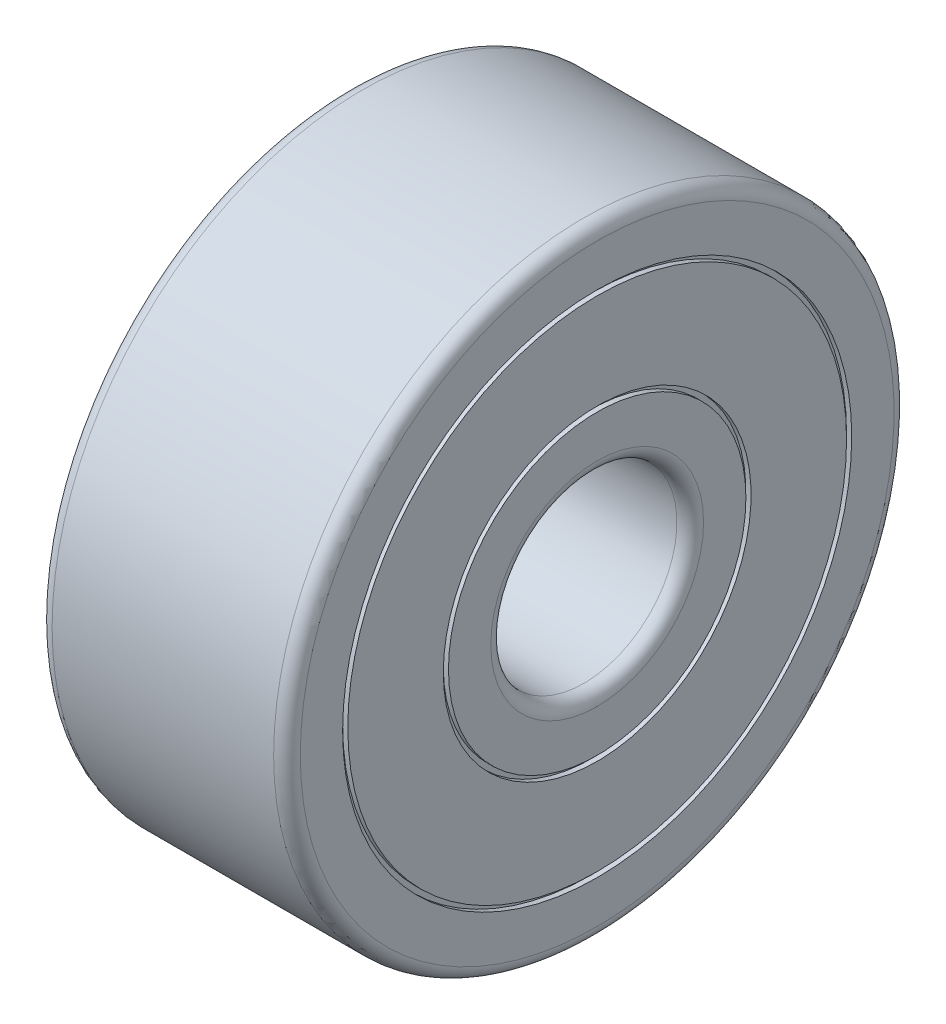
ISO-10303-21;
HEADER;
FILE_DESCRIPTION(('STEP AP214'),'2;1');
FILE_NAME('part.step','',(''),(''),'','','');
FILE_SCHEMA(('AUTOMOTIVE_DESIGN { 1 0 10303 214 1 1 1 1 }'));
ENDSEC;
DATA;
#1=APPLICATION_CONTEXT('core data for automotive mechanical design processes');
#2=APPLICATION_PROTOCOL_DEFINITION('international standard','automotive_design',2000,#1);
#3=PRODUCT_CONTEXT('',#1,'mechanical');
#4=PRODUCT('Part','Part','',(#3));
#5=PRODUCT_RELATED_PRODUCT_CATEGORY('part','',(#4));
#6=PRODUCT_DEFINITION_FORMATION('','',#4);
#7=PRODUCT_DEFINITION_CONTEXT('part definition',#1,'design');
#8=PRODUCT_DEFINITION('design','',#6,#7);
#9=PRODUCT_DEFINITION_SHAPE('','',#8);
#10=(LENGTH_UNIT() NAMED_UNIT(*) SI_UNIT(.MILLI.,.METRE.));
#11=(NAMED_UNIT(*) PLANE_ANGLE_UNIT() SI_UNIT($,.RADIAN.));
#12=(NAMED_UNIT(*) SI_UNIT($,.STERADIAN.) SOLID_ANGLE_UNIT());
#13=UNCERTAINTY_MEASURE_WITH_UNIT(LENGTH_MEASURE(1.E-05),#10,'distance_accuracy_value','');
#14=(GEOMETRIC_REPRESENTATION_CONTEXT(3) GLOBAL_UNCERTAINTY_ASSIGNED_CONTEXT((#13)) GLOBAL_UNIT_ASSIGNED_CONTEXT((#10,
#11,#12)) REPRESENTATION_CONTEXT('',''));
#15=CARTESIAN_POINT('',(0.,0.,0.));
#16=DIRECTION('',(0.,0.,1.));
#17=DIRECTION('',(1.,0.,0.));
#18=AXIS2_PLACEMENT_3D('',#15,#16,#17);
#19=CARTESIAN_POINT('',(-2.,1.71487298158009,0.));
#20=DIRECTION('',(1.,0.,0.));
#21=DIRECTION('',(0.,0.,-1.));
#22=AXIS2_PLACEMENT_3D('',#19,#20,#21);
#23=PLANE('',#22);
#24=CARTESIAN_POINT('',(-2.,0.,0.));
#25=DIRECTION('',(-1.,0.,0.));
#26=DIRECTION('',(0.,0.,1.));
#27=AXIS2_PLACEMENT_3D('',#24,#25,#26);
#28=CIRCLE('',#27,1.71487298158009);
#29=CARTESIAN_POINT('',(-2.,0.,1.71487298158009));
#30=VERTEX_POINT('',#29);
#31=EDGE_CURVE('E767',#30,#30,#28,.T.);
#32=ORIENTED_EDGE('',*,*,#31,.F.);
#33=EDGE_LOOP('',(#32));
#34=FACE_BOUND('',#33,.T.);
#35=CARTESIAN_POINT('',(-2.,0.,0.));
#36=DIRECTION('',(-1.,0.,0.));
#37=DIRECTION('',(0.,0.,1.));
#38=AXIS2_PLACEMENT_3D('',#35,#36,#37);
#39=CIRCLE('',#38,2.39725458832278);
#40=CARTESIAN_POINT('',(-2.,0.,2.39725458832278));
#41=VERTEX_POINT('',#40);
#42=EDGE_CURVE('E333',#41,#41,#39,.T.);
#43=ORIENTED_EDGE('',*,*,#42,.T.);
#44=EDGE_LOOP('',(#43));
#45=FACE_BOUND('',#44,.T.);
#46=ADVANCED_FACE('F40',(#34,#45),#23,.F.);
#47=CARTESIAN_POINT('',(-2.,3.83333333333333,0.));
#48=DIRECTION('',(1.,0.,0.));
#49=DIRECTION('',(0.,0.,-1.));
#50=AXIS2_PLACEMENT_3D('',#47,#48,#49);
#51=PLANE('',#50);
#52=CARTESIAN_POINT('',(-2.,0.,0.));
#53=DIRECTION('',(-1.,0.,0.));
#54=DIRECTION('',(0.,0.,1.));
#55=AXIS2_PLACEMENT_3D('',#52,#53,#54);
#56=CIRCLE('',#55,4.78512701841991);
#57=CARTESIAN_POINT('',(-2.,0.,4.78512701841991));
#58=VERTEX_POINT('',#57);
#59=EDGE_CURVE('E524',#58,#58,#56,.T.);
#60=ORIENTED_EDGE('',*,*,#59,.T.);
#61=EDGE_LOOP('',(#60));
#62=FACE_BOUND('',#61,.T.);
#63=CARTESIAN_POINT('',(-2.,0.,0.));
#64=DIRECTION('',(-1.,0.,0.));
#65=DIRECTION('',(0.,0.,1.));
#66=AXIS2_PLACEMENT_3D('',#63,#64,#65);
#67=CIRCLE('',#66,4.10274541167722);
#68=CARTESIAN_POINT('',(-2.,0.,4.10274541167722));
#69=VERTEX_POINT('',#68);
#70=EDGE_CURVE('E329',#69,#69,#67,.T.);
#71=ORIENTED_EDGE('',*,*,#70,.F.);
#72=EDGE_LOOP('',(#71));
#73=FACE_BOUND('',#72,.T.);
#74=ADVANCED_FACE('F390',(#62,#73),#51,.F.);
#75=CARTESIAN_POINT('',(-2.,0.,0.));
#76=DIRECTION('',(-1.,0.,0.));
#77=DIRECTION('',(0.,0.,1.));
#78=AXIS2_PLACEMENT_3D('',#75,#76,#77);
#79=CIRCLE('',#78,4.01950352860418);
#80=CARTESIAN_POINT('',(-2.,0.,4.01950352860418));
#81=VERTEX_POINT('',#80);
#82=EDGE_CURVE('E325',#81,#81,#79,.T.);
#83=ORIENTED_EDGE('',*,*,#82,.T.);
#84=EDGE_LOOP('',(#83));
#85=FACE_BOUND('',#84,.T.);
#86=CARTESIAN_POINT('',(-2.,0.,0.));
#87=DIRECTION('',(-1.,0.,0.));
#88=DIRECTION('',(0.,0.,1.));
#89=AXIS2_PLACEMENT_3D('',#86,#87,#88);
#90=CIRCLE('',#89,2.48049647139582);
#91=CARTESIAN_POINT('',(-2.,0.,2.48049647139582));
#92=VERTEX_POINT('',#91);
#93=EDGE_CURVE('E340',#92,#92,#90,.T.);
#94=ORIENTED_EDGE('',*,*,#93,.F.);
#95=EDGE_LOOP('',(#94));
#96=FACE_BOUND('',#95,.T.);
#97=ADVANCED_FACE('F923',(#85,#96),#51,.F.);
#98=CARTESIAN_POINT('',(2.,2.66666666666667,0.));
#99=DIRECTION('',(-1.,0.,0.));
#100=DIRECTION('',(0.,0.,1.));
#101=AXIS2_PLACEMENT_3D('',#98,#99,#100);
#102=PLANE('',#101);
#103=CARTESIAN_POINT('',(2.,0.,0.));
#104=DIRECTION('',(-1.,0.,0.));
#105=DIRECTION('',(0.,0.,1.));
#106=AXIS2_PLACEMENT_3D('',#103,#104,#105);
#107=CIRCLE('',#106,1.71487298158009);
#108=CARTESIAN_POINT('',(2.,0.,1.71487298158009));
#109=VERTEX_POINT('',#108);
#110=EDGE_CURVE('E749',#109,#109,#107,.T.);
#111=ORIENTED_EDGE('',*,*,#110,.T.);
#112=EDGE_LOOP('',(#111));
#113=FACE_BOUND('',#112,.T.);
#114=CARTESIAN_POINT('',(2.,0.,0.));
#115=DIRECTION('',(-1.,0.,0.));
#116=DIRECTION('',(0.,0.,1.));
#117=AXIS2_PLACEMENT_3D('',#114,#115,#116);
#118=CIRCLE('',#117,2.39725458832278);
#119=CARTESIAN_POINT('',(2.,0.,2.39725458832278));
#120=VERTEX_POINT('',#119);
#121=EDGE_CURVE('E305',#120,#120,#118,.T.);
#122=ORIENTED_EDGE('',*,*,#121,.F.);
#123=EDGE_LOOP('',(#122));
#124=FACE_BOUND('',#123,.T.);
#125=ADVANCED_FACE('F635',(#113,#124),#102,.F.);
#126=CARTESIAN_POINT('',(2.,4.78512701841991,0.));
#127=DIRECTION('',(-1.,0.,0.));
#128=DIRECTION('',(0.,0.,1.));
#129=AXIS2_PLACEMENT_3D('',#126,#127,#128);
#130=PLANE('',#129);
#131=CARTESIAN_POINT('',(2.,0.,0.));
#132=DIRECTION('',(-1.,0.,0.));
#133=DIRECTION('',(0.,0.,1.));
#134=AXIS2_PLACEMENT_3D('',#131,#132,#133);
#135=CIRCLE('',#134,4.01950352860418);
#136=CARTESIAN_POINT('',(2.,0.,4.01950352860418));
#137=VERTEX_POINT('',#136);
#138=EDGE_CURVE('E297',#137,#137,#135,.T.);
#139=ORIENTED_EDGE('',*,*,#138,.F.);
#140=EDGE_LOOP('',(#139));
#141=FACE_BOUND('',#140,.T.);
#142=CARTESIAN_POINT('',(2.,0.,0.));
#143=DIRECTION('',(-1.,0.,0.));
#144=DIRECTION('',(0.,0.,1.));
#145=AXIS2_PLACEMENT_3D('',#142,#143,#144);
#146=CIRCLE('',#145,2.48049647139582);
#147=CARTESIAN_POINT('',(2.,0.,2.48049647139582));
#148=VERTEX_POINT('',#147);
#149=EDGE_CURVE('E309',#148,#148,#146,.T.);
#150=ORIENTED_EDGE('',*,*,#149,.T.);
#151=EDGE_LOOP('',(#150));
#152=FACE_BOUND('',#151,.T.);
#153=ADVANCED_FACE('F543',(#141,#152),#130,.F.);
#154=CARTESIAN_POINT('',(2.,0.,0.));
#155=DIRECTION('',(-1.,0.,0.));
#156=DIRECTION('',(0.,0.,1.));
#157=AXIS2_PLACEMENT_3D('',#154,#155,#156);
#158=CIRCLE('',#157,4.78512701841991);
#159=CARTESIAN_POINT('',(2.,0.,4.78512701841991));
#160=VERTEX_POINT('',#159);
#161=EDGE_CURVE('E265',#160,#160,#158,.T.);
#162=ORIENTED_EDGE('',*,*,#161,.F.);
#163=EDGE_LOOP('',(#162));
#164=FACE_BOUND('',#163,.T.);
#165=CARTESIAN_POINT('',(2.,0.,0.));
#166=DIRECTION('',(-1.,0.,0.));
#167=DIRECTION('',(0.,0.,1.));
#168=AXIS2_PLACEMENT_3D('',#165,#166,#167);
#169=CIRCLE('',#168,4.10274541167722);
#170=CARTESIAN_POINT('',(2.,0.,4.10274541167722));
#171=VERTEX_POINT('',#170);
#172=EDGE_CURVE('E293',#171,#171,#169,.T.);
#173=ORIENTED_EDGE('',*,*,#172,.T.);
#174=EDGE_LOOP('',(#173));
#175=FACE_BOUND('',#174,.T.);
#176=ADVANCED_FACE('F938',(#164,#175),#130,.F.);
#177=CARTESIAN_POINT('',(1.78512701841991,0.,0.));
#178=DIRECTION('',(-1.,0.,0.));
#179=DIRECTION('',(0.,0.,1.));
#180=AXIS2_PLACEMENT_3D('',#177,#178,#179);
#181=TOROIDAL_SURFACE('',#180,1.71487298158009,0.21487298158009);
#182=ORIENTED_EDGE('',*,*,#110,.F.);
#183=EDGE_LOOP('',(#182));
#184=FACE_BOUND('',#183,.T.);
#185=CARTESIAN_POINT('',(1.7851270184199,0.,0.));
#186=DIRECTION('',(-1.,0.,0.));
#187=DIRECTION('',(0.,0.,1.));
#188=AXIS2_PLACEMENT_3D('',#185,#186,#187);
#189=CIRCLE('',#188,1.5);
#190=CARTESIAN_POINT('',(1.7851270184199,0.,1.5));
#191=VERTEX_POINT('',#190);
#192=EDGE_CURVE('E772',#191,#191,#189,.T.);
#193=ORIENTED_EDGE('',*,*,#192,.T.);
#194=EDGE_LOOP('',(#193));
#195=FACE_BOUND('',#194,.T.);
#196=ADVANCED_FACE('F42',(#184,#195),#181,.T.);
#197=CARTESIAN_POINT('',(-1.78512701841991,0.,0.));
#198=DIRECTION('',(-1.,0.,0.));
#199=DIRECTION('',(0.,0.,1.));
#200=AXIS2_PLACEMENT_3D('',#197,#198,#199);
#201=TOROIDAL_SURFACE('',#200,1.71487298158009,0.214872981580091);
#202=CARTESIAN_POINT('',(-1.7851270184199,0.,0.));
#203=DIRECTION('',(-1.,0.,0.));
#204=DIRECTION('',(0.,0.,1.));
#205=AXIS2_PLACEMENT_3D('',#202,#203,#204);
#206=CIRCLE('',#205,1.5);
#207=CARTESIAN_POINT('',(-1.7851270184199,0.,1.5));
#208=VERTEX_POINT('',#207);
#209=EDGE_CURVE('E770',#208,#208,#206,.T.);
#210=ORIENTED_EDGE('',*,*,#209,.F.);
#211=EDGE_LOOP('',(#210));
#212=FACE_BOUND('',#211,.T.);
#213=ORIENTED_EDGE('',*,*,#31,.T.);
#214=EDGE_LOOP('',(#213));
#215=FACE_BOUND('',#214,.T.);
#216=ADVANCED_FACE('F930',(#212,#215),#201,.T.);
#217=CARTESIAN_POINT('',(-2.,0.,0.));
#218=DIRECTION('',(-1.,0.,0.));
#219=DIRECTION('',(0.,0.,1.));
#220=AXIS2_PLACEMENT_3D('',#217,#218,#219);
#221=CYLINDRICAL_SURFACE('',#220,1.5);
#222=ORIENTED_EDGE('',*,*,#192,.F.);
#223=EDGE_LOOP('',(#222));
#224=FACE_BOUND('',#223,.T.);
#225=ORIENTED_EDGE('',*,*,#209,.T.);
#226=EDGE_LOOP('',(#225));
#227=FACE_BOUND('',#226,.T.);
#228=ADVANCED_FACE('F915',(#224,#227),#221,.F.);
#229=CARTESIAN_POINT('',(-1.78512701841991,0.,0.));
#230=DIRECTION('',(-1.,0.,0.));
#231=DIRECTION('',(0.,0.,1.));
#232=AXIS2_PLACEMENT_3D('',#229,#230,#231);
#233=TOROIDAL_SURFACE('',#232,4.78512701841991,0.214872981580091);
#234=ORIENTED_EDGE('',*,*,#59,.F.);
#235=EDGE_LOOP('',(#234));
#236=FACE_BOUND('',#235,.T.);
#237=CARTESIAN_POINT('',(-1.78512701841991,0.,0.));
#238=DIRECTION('',(-1.,0.,0.));
#239=DIRECTION('',(0.,0.,1.));
#240=AXIS2_PLACEMENT_3D('',#237,#238,#239);
#241=CIRCLE('',#240,5.);
#242=CARTESIAN_POINT('',(-1.78512701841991,0.,5.));
#243=VERTEX_POINT('',#242);
#244=EDGE_CURVE('E280',#243,#243,#241,.T.);
#245=ORIENTED_EDGE('',*,*,#244,.T.);
#246=EDGE_LOOP('',(#245));
#247=FACE_BOUND('',#246,.T.);
#248=ADVANCED_FACE('F910',(#236,#247),#233,.T.);
#249=CARTESIAN_POINT('',(1.78512701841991,0.,0.));
#250=DIRECTION('',(-1.,0.,0.));
#251=DIRECTION('',(0.,0.,1.));
#252=AXIS2_PLACEMENT_3D('',#249,#250,#251);
#253=TOROIDAL_SURFACE('',#252,4.78512701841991,0.214872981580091);
#254=CARTESIAN_POINT('',(1.78512701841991,0.,0.));
#255=DIRECTION('',(-1.,0.,0.));
#256=DIRECTION('',(0.,0.,1.));
#257=AXIS2_PLACEMENT_3D('',#254,#255,#256);
#258=CIRCLE('',#257,5.);
#259=CARTESIAN_POINT('',(1.78512701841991,0.,5.));
#260=VERTEX_POINT('',#259);
#261=EDGE_CURVE('E273',#260,#260,#258,.T.);
#262=ORIENTED_EDGE('',*,*,#261,.F.);
#263=EDGE_LOOP('',(#262));
#264=FACE_BOUND('',#263,.T.);
#265=ORIENTED_EDGE('',*,*,#161,.T.);
#266=EDGE_LOOP('',(#265));
#267=FACE_BOUND('',#266,.T.);
#268=ADVANCED_FACE('F907',(#264,#267),#253,.T.);
#269=CARTESIAN_POINT('',(-2.,0.,0.));
#270=DIRECTION('',(-1.,0.,0.));
#271=DIRECTION('',(0.,0.,1.));
#272=AXIS2_PLACEMENT_3D('',#269,#270,#271);
#273=CYLINDRICAL_SURFACE('',#272,5.);
#274=ORIENTED_EDGE('',*,*,#244,.F.);
#275=EDGE_LOOP('',(#274));
#276=FACE_BOUND('',#275,.T.);
#277=ORIENTED_EDGE('',*,*,#261,.T.);
#278=EDGE_LOOP('',(#277));
#279=FACE_BOUND('',#278,.T.);
#280=ADVANCED_FACE('F904',(#276,#279),#273,.T.);
#281=CARTESIAN_POINT('',(-2.,0.,0.));
#282=DIRECTION('',(-1.,0.,0.));
#283=DIRECTION('',(0.,0.,1.));
#284=AXIS2_PLACEMENT_3D('',#281,#282,#283);
#285=CYLINDRICAL_SURFACE('',#284,4.01950352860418);
#286=ORIENTED_EDGE('',*,*,#138,.T.);
#287=EDGE_LOOP('',(#286));
#288=FACE_BOUND('',#287,.T.);
#289=CARTESIAN_POINT('',(1.91675811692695,0.,0.));
#290=DIRECTION('',(-1.,0.,0.));
#291=DIRECTION('',(0.,0.,1.));
#292=AXIS2_PLACEMENT_3D('',#289,#290,#291);
#293=CIRCLE('',#292,4.01950352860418);
#294=CARTESIAN_POINT('',(1.91675811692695,0.,4.01950352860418));
#295=VERTEX_POINT('',#294);
#296=EDGE_CURVE('E286',#295,#295,#293,.T.);
#297=ORIENTED_EDGE('',*,*,#296,.F.);
#298=EDGE_LOOP('',(#297));
#299=FACE_BOUND('',#298,.T.);
#300=ADVANCED_FACE('F900',(#288,#299),#285,.T.);
#301=CARTESIAN_POINT('',(1.91675811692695,4.10274541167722,0.));
#302=DIRECTION('',(1.,0.,0.));
#303=DIRECTION('',(0.,0.,-1.));
#304=AXIS2_PLACEMENT_3D('',#301,#302,#303);
#305=PLANE('',#304);
#306=ORIENTED_EDGE('',*,*,#296,.T.);
#307=EDGE_LOOP('',(#306));
#308=FACE_BOUND('',#307,.T.);
#309=CARTESIAN_POINT('',(1.91675811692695,0.,0.));
#310=DIRECTION('',(-1.,0.,0.));
#311=DIRECTION('',(0.,0.,1.));
#312=AXIS2_PLACEMENT_3D('',#309,#310,#311);
#313=CIRCLE('',#312,4.10274541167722);
#314=CARTESIAN_POINT('',(1.91675811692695,0.,4.10274541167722));
#315=VERTEX_POINT('',#314);
#316=EDGE_CURVE('E290',#315,#315,#313,.T.);
#317=ORIENTED_EDGE('',*,*,#316,.F.);
#318=EDGE_LOOP('',(#317));
#319=FACE_BOUND('',#318,.T.);
#320=ADVANCED_FACE('F896',(#308,#319),#305,.T.);
#321=CARTESIAN_POINT('',(-2.,0.,0.));
#322=DIRECTION('',(-1.,0.,0.));
#323=DIRECTION('',(0.,0.,1.));
#324=AXIS2_PLACEMENT_3D('',#321,#322,#323);
#325=CYLINDRICAL_SURFACE('',#324,4.10274541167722);
#326=ORIENTED_EDGE('',*,*,#316,.T.);
#327=EDGE_LOOP('',(#326));
#328=FACE_BOUND('',#327,.T.);
#329=ORIENTED_EDGE('',*,*,#172,.F.);
#330=EDGE_LOOP('',(#329));
#331=FACE_BOUND('',#330,.T.);
#332=ADVANCED_FACE('F886',(#328,#331),#325,.F.);
#333=CARTESIAN_POINT('',(1.91675811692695,2.39725458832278,0.));
#334=DIRECTION('',(1.,0.,0.));
#335=DIRECTION('',(0.,0.,-1.));
#336=AXIS2_PLACEMENT_3D('',#333,#334,#335);
#337=PLANE('',#336);
#338=CARTESIAN_POINT('',(1.91675811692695,0.,0.));
#339=DIRECTION('',(-1.,0.,0.));
#340=DIRECTION('',(0.,0.,1.));
#341=AXIS2_PLACEMENT_3D('',#338,#339,#340);
#342=CIRCLE('',#341,2.39725458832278);
#343=CARTESIAN_POINT('',(1.91675811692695,0.,2.39725458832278));
#344=VERTEX_POINT('',#343);
#345=EDGE_CURVE('E301',#344,#344,#342,.T.);
#346=ORIENTED_EDGE('',*,*,#345,.T.);
#347=EDGE_LOOP('',(#346));
#348=FACE_BOUND('',#347,.T.);
#349=CARTESIAN_POINT('',(1.91675811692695,0.,0.));
#350=DIRECTION('',(-1.,0.,0.));
#351=DIRECTION('',(0.,0.,1.));
#352=AXIS2_PLACEMENT_3D('',#349,#350,#351);
#353=CIRCLE('',#352,2.48049647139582);
#354=CARTESIAN_POINT('',(1.91675811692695,0.,2.48049647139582));
#355=VERTEX_POINT('',#354);
#356=EDGE_CURVE('E313',#355,#355,#353,.T.);
#357=ORIENTED_EDGE('',*,*,#356,.F.);
#358=EDGE_LOOP('',(#357));
#359=FACE_BOUND('',#358,.T.);
#360=ADVANCED_FACE('F882',(#348,#359),#337,.T.);
#361=CARTESIAN_POINT('',(-2.,0.,0.));
#362=DIRECTION('',(-1.,0.,0.));
#363=DIRECTION('',(0.,0.,1.));
#364=AXIS2_PLACEMENT_3D('',#361,#362,#363);
#365=CYLINDRICAL_SURFACE('',#364,2.48049647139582);
#366=ORIENTED_EDGE('',*,*,#356,.T.);
#367=EDGE_LOOP('',(#366));
#368=FACE_BOUND('',#367,.T.);
#369=ORIENTED_EDGE('',*,*,#149,.F.);
#370=EDGE_LOOP('',(#369));
#371=FACE_BOUND('',#370,.T.);
#372=ADVANCED_FACE('F885',(#368,#371),#365,.F.);
#373=CARTESIAN_POINT('',(-2.,0.,0.));
#374=DIRECTION('',(-1.,0.,0.));
#375=DIRECTION('',(0.,0.,1.));
#376=AXIS2_PLACEMENT_3D('',#373,#374,#375);
#377=CYLINDRICAL_SURFACE('',#376,2.39725458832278);
#378=ORIENTED_EDGE('',*,*,#121,.T.);
#379=EDGE_LOOP('',(#378));
#380=FACE_BOUND('',#379,.T.);
#381=ORIENTED_EDGE('',*,*,#345,.F.);
#382=EDGE_LOOP('',(#381));
#383=FACE_BOUND('',#382,.T.);
#384=ADVANCED_FACE('F880',(#380,#383),#377,.T.);
#385=CARTESIAN_POINT('',(-2.,0.,0.));
#386=DIRECTION('',(-1.,0.,0.));
#387=DIRECTION('',(0.,0.,1.));
#388=AXIS2_PLACEMENT_3D('',#385,#386,#387);
#389=CYLINDRICAL_SURFACE('',#388,4.10274541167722);
#390=ORIENTED_EDGE('',*,*,#70,.T.);
#391=EDGE_LOOP('',(#390));
#392=FACE_BOUND('',#391,.T.);
#393=CARTESIAN_POINT('',(-1.91675811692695,0.,0.));
#394=DIRECTION('',(-1.,0.,0.));
#395=DIRECTION('',(0.,0.,1.));
#396=AXIS2_PLACEMENT_3D('',#393,#394,#395);
#397=CIRCLE('',#396,4.10274541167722);
#398=CARTESIAN_POINT('',(-1.91675811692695,0.,4.10274541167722));
#399=VERTEX_POINT('',#398);
#400=EDGE_CURVE('E317',#399,#399,#397,.T.);
#401=ORIENTED_EDGE('',*,*,#400,.F.);
#402=EDGE_LOOP('',(#401));
#403=FACE_BOUND('',#402,.T.);
#404=ADVANCED_FACE('F876',(#392,#403),#389,.F.);
#405=CARTESIAN_POINT('',(-1.91675811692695,4.10274541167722,0.));
#406=DIRECTION('',(-1.,0.,0.));
#407=DIRECTION('',(0.,0.,1.));
#408=AXIS2_PLACEMENT_3D('',#405,#406,#407);
#409=PLANE('',#408);
#410=ORIENTED_EDGE('',*,*,#400,.T.);
#411=EDGE_LOOP('',(#410));
#412=FACE_BOUND('',#411,.T.);
#413=CARTESIAN_POINT('',(-1.91675811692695,0.,0.));
#414=DIRECTION('',(-1.,0.,0.));
#415=DIRECTION('',(0.,0.,1.));
#416=AXIS2_PLACEMENT_3D('',#413,#414,#415);
#417=CIRCLE('',#416,4.01950352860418);
#418=CARTESIAN_POINT('',(-1.91675811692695,0.,4.01950352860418));
#419=VERTEX_POINT('',#418);
#420=EDGE_CURVE('E321',#419,#419,#417,.T.);
#421=ORIENTED_EDGE('',*,*,#420,.F.);
#422=EDGE_LOOP('',(#421));
#423=FACE_BOUND('',#422,.T.);
#424=ADVANCED_FACE('F872',(#412,#423),#409,.T.);
#425=CARTESIAN_POINT('',(-2.,0.,0.));
#426=DIRECTION('',(-1.,0.,0.));
#427=DIRECTION('',(0.,0.,1.));
#428=AXIS2_PLACEMENT_3D('',#425,#426,#427);
#429=CYLINDRICAL_SURFACE('',#428,4.01950352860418);
#430=ORIENTED_EDGE('',*,*,#420,.T.);
#431=EDGE_LOOP('',(#430));
#432=FACE_BOUND('',#431,.T.);
#433=ORIENTED_EDGE('',*,*,#82,.F.);
#434=EDGE_LOOP('',(#433));
#435=FACE_BOUND('',#434,.T.);
#436=ADVANCED_FACE('F862',(#432,#435),#429,.T.);
#437=CARTESIAN_POINT('',(-1.91675811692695,2.39725458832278,0.));
#438=DIRECTION('',(-1.,0.,0.));
#439=DIRECTION('',(0.,0.,1.));
#440=AXIS2_PLACEMENT_3D('',#437,#438,#439);
#441=PLANE('',#440);
#442=CARTESIAN_POINT('',(-1.91675811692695,0.,0.));
#443=DIRECTION('',(-1.,0.,0.));
#444=DIRECTION('',(0.,0.,1.));
#445=AXIS2_PLACEMENT_3D('',#442,#443,#444);
#446=CIRCLE('',#445,2.48049647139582);
#447=CARTESIAN_POINT('',(-1.91675811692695,0.,2.48049647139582));
#448=VERTEX_POINT('',#447);
#449=EDGE_CURVE('E337',#448,#448,#446,.T.);
#450=ORIENTED_EDGE('',*,*,#449,.T.);
#451=EDGE_LOOP('',(#450));
#452=FACE_BOUND('',#451,.T.);
#453=CARTESIAN_POINT('',(-1.91675811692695,0.,0.));
#454=DIRECTION('',(-1.,0.,0.));
#455=DIRECTION('',(0.,0.,1.));
#456=AXIS2_PLACEMENT_3D('',#453,#454,#455);
#457=CIRCLE('',#456,2.39725458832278);
#458=CARTESIAN_POINT('',(-1.91675811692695,0.,2.39725458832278));
#459=VERTEX_POINT('',#458);
#460=EDGE_CURVE('E334',#459,#459,#457,.T.);
#461=ORIENTED_EDGE('',*,*,#460,.F.);
#462=EDGE_LOOP('',(#461));
#463=FACE_BOUND('',#462,.T.);
#464=ADVANCED_FACE('F858',(#452,#463),#441,.T.);
#465=CARTESIAN_POINT('',(-2.,0.,0.));
#466=DIRECTION('',(-1.,0.,0.));
#467=DIRECTION('',(0.,0.,1.));
#468=AXIS2_PLACEMENT_3D('',#465,#466,#467);
#469=CYLINDRICAL_SURFACE('',#468,2.48049647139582);
#470=ORIENTED_EDGE('',*,*,#93,.T.);
#471=EDGE_LOOP('',(#470));
#472=FACE_BOUND('',#471,.T.);
#473=ORIENTED_EDGE('',*,*,#449,.F.);
#474=EDGE_LOOP('',(#473));
#475=FACE_BOUND('',#474,.T.);
#476=ADVANCED_FACE('F861',(#472,#475),#469,.F.);
#477=CARTESIAN_POINT('',(-2.,0.,0.));
#478=DIRECTION('',(-1.,0.,0.));
#479=DIRECTION('',(0.,0.,1.));
#480=AXIS2_PLACEMENT_3D('',#477,#478,#479);
#481=CYLINDRICAL_SURFACE('',#480,2.39725458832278);
#482=ORIENTED_EDGE('',*,*,#460,.T.);
#483=EDGE_LOOP('',(#482));
#484=FACE_BOUND('',#483,.T.);
#485=ORIENTED_EDGE('',*,*,#42,.F.);
#486=EDGE_LOOP('',(#485));
#487=FACE_BOUND('',#486,.T.);
#488=ADVANCED_FACE('F866',(#484,#487),#481,.T.);
#489=CLOSED_SHELL('',(#46,#74,#97,#125,#153,#176,#196,#216,#228,#248,#268,#280,#300,#320,#332,
#360,#372,#384,#404,#424,#436,#464,#476,#488));
#490=CARTESIAN_POINT('',(1.52791182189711,4.10274541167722,0.));
#491=DIRECTION('',(1.,0.,0.));
#492=DIRECTION('',(0.,0.,-1.));
#493=AXIS2_PLACEMENT_3D('',#490,#491,#492);
#494=PLANE('',#493);
#495=CARTESIAN_POINT('',(1.52791182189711,0.,0.));
#496=DIRECTION('',(1.,0.,0.));
#497=DIRECTION('',(0.,0.,-1.));
#498=AXIS2_PLACEMENT_3D('',#495,#496,#497);
#499=CIRCLE('',#498,3.83333333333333);
#500=CARTESIAN_POINT('',(1.52791182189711,0.,-3.83333333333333));
#501=VERTEX_POINT('',#500);
#502=EDGE_CURVE('E44',#501,#501,#499,.F.);
#503=ORIENTED_EDGE('',*,*,#502,.T.);
#504=EDGE_LOOP('',(#503));
#505=FACE_BOUND('',#504,.T.);
#506=CARTESIAN_POINT('',(1.52791182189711,0.,0.));
#507=DIRECTION('',(1.,0.,0.));
#508=DIRECTION('',(0.,0.,-1.));
#509=AXIS2_PLACEMENT_3D('',#506,#507,#508);
#510=CIRCLE('',#509,2.66666666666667);
#511=CARTESIAN_POINT('',(1.52791182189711,0.,-2.66666666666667));
#512=VERTEX_POINT('',#511);
#513=EDGE_CURVE('E11',#512,#512,#510,.T.);
#514=ORIENTED_EDGE('',*,*,#513,.T.);
#515=EDGE_LOOP('',(#514));
#516=FACE_BOUND('',#515,.T.);
#517=ADVANCED_FACE('F847',(#505,#516),#494,.F.);
#518=CARTESIAN_POINT('',(-1.52791182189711,4.10274541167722,0.));
#519=DIRECTION('',(-1.,0.,0.));
#520=DIRECTION('',(0.,0.,1.));
#521=AXIS2_PLACEMENT_3D('',#518,#519,#520);
#522=PLANE('',#521);
#523=CARTESIAN_POINT('',(-1.52791182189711,0.,0.));
#524=DIRECTION('',(-1.,0.,0.));
#525=DIRECTION('',(0.,0.,1.));
#526=AXIS2_PLACEMENT_3D('',#523,#524,#525);
#527=CIRCLE('',#526,3.83333333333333);
#528=CARTESIAN_POINT('',(-1.52791182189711,0.,3.83333333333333));
#529=VERTEX_POINT('',#528);
#530=EDGE_CURVE('E348',#529,#529,#527,.F.);
#531=ORIENTED_EDGE('',*,*,#530,.T.);
#532=EDGE_LOOP('',(#531));
#533=FACE_BOUND('',#532,.T.);
#534=CARTESIAN_POINT('',(-1.52791182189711,0.,0.));
#535=DIRECTION('',(-1.,0.,0.));
#536=DIRECTION('',(0.,0.,1.));
#537=AXIS2_PLACEMENT_3D('',#534,#535,#536);
#538=CIRCLE('',#537,2.66666666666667);
#539=CARTESIAN_POINT('',(-1.52791182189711,0.,2.66666666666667));
#540=VERTEX_POINT('',#539);
#541=EDGE_CURVE('E345',#540,#540,#538,.T.);
#542=ORIENTED_EDGE('',*,*,#541,.T.);
#543=EDGE_LOOP('',(#542));
#544=FACE_BOUND('',#543,.T.);
#545=ADVANCED_FACE('F720',(#533,#544),#522,.F.);
#546=CARTESIAN_POINT('',(-2.,0.,0.));
#547=DIRECTION('',(-1.,0.,0.));
#548=DIRECTION('',(0.,0.,1.));
#549=AXIS2_PLACEMENT_3D('',#546,#547,#548);
#550=CYLINDRICAL_SURFACE('',#549,2.66666666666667);
#551=CARTESIAN_POINT('',(-0.879848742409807,1.11809061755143,-2.42094702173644));
#552=CARTESIAN_POINT('',(-0.89322162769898,1.15415345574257,-2.40432964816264));
#553=CARTESIAN_POINT('',(-0.903297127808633,1.19083206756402,-2.38637531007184));
#554=CARTESIAN_POINT('',(-0.916448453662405,1.26326084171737,-2.34879905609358));
#555=CARTESIAN_POINT('',(-0.919711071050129,1.29900847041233,-2.32923736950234));
#556=CARTESIAN_POINT('',(-0.919594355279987,1.36923952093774,-2.28865145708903));
#557=CARTESIAN_POINT('',(-0.916272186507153,1.40373119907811,-2.26764133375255));
#558=CARTESIAN_POINT('',(-0.903116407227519,1.47184803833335,-2.22407238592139));
#559=CARTESIAN_POINT('',(-0.893100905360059,1.50542092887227,-2.20148654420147));
#560=CARTESIAN_POINT('',(-0.879848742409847,1.53755631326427,-2.17876838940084));
#561=B_SPLINE_CURVE_WITH_KNOTS('',3,(#551,#552,#553,#554,#555,#556,#557,#558,#559,#560),
.UNSPECIFIED.,.F.,.F.,(4,2,2,2,4),(0.,0.125560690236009,0.247631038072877,0.368646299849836,
0.493091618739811),.UNSPECIFIED.);
#562=CARTESIAN_POINT('',(-0.880048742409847,1.11863257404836,-2.42069665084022));
#563=VERTEX_POINT('',#562);
#564=CARTESIAN_POINT('',(-0.880048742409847,1.5370685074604,-2.17911255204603));
#565=VERTEX_POINT('',#564);
#566=EDGE_CURVE('E705',#563,#565,#561,.T.);
#567=ORIENTED_EDGE('',*,*,#566,.F.);
#568=CARTESIAN_POINT('',(-0.880048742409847,0.,0.));
#569=DIRECTION('',(-1.,0.,0.));
#570=DIRECTION('',(0.,0.,1.));
#571=AXIS2_PLACEMENT_3D('',#568,#569,#570);
#572=CIRCLE('',#571,2.66666666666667);
#573=CARTESIAN_POINT('',(-0.880048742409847,-1.11863257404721,-2.42069665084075));
#574=VERTEX_POINT('',#573);
#575=EDGE_CURVE('E765',#563,#574,#572,.T.);
#576=ORIENTED_EDGE('',*,*,#575,.T.);
#577=CARTESIAN_POINT('',(-0.879848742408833,-1.5375563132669,-2.17876838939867));
#578=CARTESIAN_POINT('',(-0.893221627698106,-1.50513382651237,-2.20169103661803));
#579=CARTESIAN_POINT('',(-0.903297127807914,-1.47124560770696,-2.22447847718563));
#580=CARTESIAN_POINT('',(-0.916448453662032,-1.40248923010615,-2.26841550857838));
#581=CARTESIAN_POINT('',(-0.919711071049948,-1.36767449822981,-2.28959301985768));
#582=CARTESIAN_POINT('',(-0.919594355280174,-1.29741054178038,-2.3301219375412));
#583=CARTESIAN_POINT('',(-0.916272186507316,-1.26196940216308,-2.34948754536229));
#584=CARTESIAN_POINT('',(-0.903116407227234,-1.19017916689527,-2.38669398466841));
#585=CARTESIAN_POINT('',(-0.893100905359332,-1.15383280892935,-2.40447603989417));
#586=CARTESIAN_POINT('',(-0.879848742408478,-1.1180906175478,-2.42094702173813));
#587=B_SPLINE_CURVE_WITH_KNOTS('',3,(#577,#578,#579,#580,#581,#582,#583,#584,#585,#586),
.UNSPECIFIED.,.F.,.F.,(4,2,2,2,4),(0.,0.125560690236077,0.247631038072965,0.368646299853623,
0.493091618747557),.UNSPECIFIED.);
#588=CARTESIAN_POINT('',(-0.880048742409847,-1.53706850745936,-2.17911255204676));
#589=VERTEX_POINT('',#588);
#590=EDGE_CURVE('E709',#589,#574,#587,.T.);
#591=ORIENTED_EDGE('',*,*,#590,.F.);
#592=CARTESIAN_POINT('',(-0.880048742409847,-2.65570108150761,-0.241584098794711));
#593=VERTEX_POINT('',#592);
#594=EDGE_CURVE('E830',#589,#593,#572,.T.);
#595=ORIENTED_EDGE('',*,*,#594,.T.);
#596=CARTESIAN_POINT('',(-0.879848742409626,-2.65564693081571,0.242178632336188));
#597=CARTESIAN_POINT('',(-0.893221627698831,-2.65928728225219,0.202638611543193));
#598=CARTESIAN_POINT('',(-0.903297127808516,-2.66207767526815,0.161896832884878));
#599=CARTESIAN_POINT('',(-0.916448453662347,-2.66575007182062,0.0803835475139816));
#600=CARTESIAN_POINT('',(-0.9197110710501,-2.66668296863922,0.0396443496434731));
#601=CARTESIAN_POINT('',(-0.919594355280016,-2.66665006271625,-0.0414704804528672));
#602=CARTESIAN_POINT('',(-0.916272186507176,-2.66570060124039,-0.0818462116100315));
#603=CARTESIAN_POINT('',(-0.903116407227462,-2.66202720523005,-0.162621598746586));
#604=CARTESIAN_POINT('',(-0.893100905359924,-2.65925373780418,-0.202989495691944));
#605=CARTESIAN_POINT('',(-0.879848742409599,-2.6556469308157,-0.242178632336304));
#606=B_SPLINE_CURVE_WITH_KNOTS('',3,(#596,#597,#598,#599,#600,#601,#602,#603,#604,#605),
.UNSPECIFIED.,.F.,.F.,(4,2,2,2,4),(0.,0.125560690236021,0.247631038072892,0.368646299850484,
0.493091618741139),.UNSPECIFIED.);
#607=CARTESIAN_POINT('',(-0.880048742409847,-2.65570108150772,0.241584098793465));
#608=VERTEX_POINT('',#607);
#609=EDGE_CURVE('E595',#608,#593,#606,.T.);
#610=ORIENTED_EDGE('',*,*,#609,.F.);
#611=CARTESIAN_POINT('',(-0.880048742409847,-1.53706850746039,2.17911255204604));
#612=VERTEX_POINT('',#611);
#613=EDGE_CURVE('E808',#608,#612,#572,.T.);
#614=ORIENTED_EDGE('',*,*,#613,.T.);
#615=CARTESIAN_POINT('',(-0.879848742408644,-1.11809061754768,2.42094702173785));
#616=CARTESIAN_POINT('',(-0.893221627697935,-1.15415345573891,2.40432964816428));
#617=CARTESIAN_POINT('',(-0.903297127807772,-1.1908320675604,2.38637531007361));
#618=CARTESIAN_POINT('',(-0.916448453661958,-1.2632608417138,2.34879905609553));
#619=CARTESIAN_POINT('',(-0.919711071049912,-1.29900847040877,2.32923736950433));
#620=CARTESIAN_POINT('',(-0.919594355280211,-1.36923952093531,2.2886514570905));
#621=CARTESIAN_POINT('',(-0.916272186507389,-1.40373119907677,2.26764133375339));
#622=CARTESIAN_POINT('',(-0.903116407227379,-1.47184803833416,2.22407238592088));
#623=CARTESIAN_POINT('',(-0.893100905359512,-1.50542092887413,2.20148654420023));
#624=CARTESIAN_POINT('',(-0.879848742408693,-1.53755631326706,2.17876838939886));
#625=B_SPLINE_CURVE_WITH_KNOTS('',3,(#615,#616,#617,#618,#619,#620,#621,#622,#623,#624),
.UNSPECIFIED.,.F.,.F.,(4,2,2,2,4),(0.,0.125560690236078,0.247631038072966,0.368646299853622,
0.493091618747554),.UNSPECIFIED.);
#626=CARTESIAN_POINT('',(-0.880048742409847,-1.11863257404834,2.42069665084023));
#627=VERTEX_POINT('',#626);
#628=EDGE_CURVE('E733',#627,#612,#625,.T.);
#629=ORIENTED_EDGE('',*,*,#628,.F.);
#630=CARTESIAN_POINT('',(-0.880048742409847,1.11863257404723,2.42069665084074));
#631=VERTEX_POINT('',#630);
#632=EDGE_CURVE('E827',#627,#631,#572,.T.);
#633=ORIENTED_EDGE('',*,*,#632,.T.);
#634=CARTESIAN_POINT('',(-0.879848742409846,1.53755631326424,2.17876838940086));
#635=CARTESIAN_POINT('',(-0.893221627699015,1.50513382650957,2.20169103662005));
#636=CARTESIAN_POINT('',(-0.903297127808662,1.47124560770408,2.22447847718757));
#637=CARTESIAN_POINT('',(-0.91644845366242,1.40248923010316,2.26841550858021));
#638=CARTESIAN_POINT('',(-0.919711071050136,1.3676744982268,2.28959301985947));
#639=CARTESIAN_POINT('',(-0.919594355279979,1.2974105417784,2.33012193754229));
#640=CARTESIAN_POINT('',(-0.916272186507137,1.26196940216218,2.34948754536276));
#641=CARTESIAN_POINT('',(-0.903116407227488,1.19017916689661,2.38669398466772));
#642=CARTESIAN_POINT('',(-0.893100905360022,1.15383280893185,2.40447603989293));
#643=CARTESIAN_POINT('',(-0.879848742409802,1.1180906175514,2.42094702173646));
#644=B_SPLINE_CURVE_WITH_KNOTS('',3,(#634,#635,#636,#637,#638,#639,#640,#641,#642,#643),
.UNSPECIFIED.,.F.,.F.,(4,2,2,2,4),(0.,0.125560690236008,0.247631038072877,0.368646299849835,
0.49309161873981),.UNSPECIFIED.);
#645=CARTESIAN_POINT('',(-0.880048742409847,1.53706850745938,2.17911255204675));
#646=VERTEX_POINT('',#645);
#647=EDGE_CURVE('E438',#646,#631,#644,.T.);
#648=ORIENTED_EDGE('',*,*,#647,.F.);
#649=CARTESIAN_POINT('',(-0.880048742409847,2.65570108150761,0.241584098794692));
#650=VERTEX_POINT('',#649);
#651=EDGE_CURVE('E766',#646,#650,#572,.T.);
#652=ORIENTED_EDGE('',*,*,#651,.T.);
#653=CARTESIAN_POINT('',(-0.879848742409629,2.65564693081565,-0.242178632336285));
#654=CARTESIAN_POINT('',(-0.89322162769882,2.65928728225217,-0.202638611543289));
#655=CARTESIAN_POINT('',(-0.903297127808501,2.66207767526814,-0.161896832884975));
#656=CARTESIAN_POINT('',(-0.916448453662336,2.66575007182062,-0.0803835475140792));
#657=CARTESIAN_POINT('',(-0.919711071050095,2.66668296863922,-0.0396443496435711));
#658=CARTESIAN_POINT('',(-0.919594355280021,2.66665006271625,0.0414704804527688));
#659=CARTESIAN_POINT('',(-0.916272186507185,2.6657006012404,0.0818462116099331));
#660=CARTESIAN_POINT('',(-0.903116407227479,2.66202720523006,0.162621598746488));
#661=CARTESIAN_POINT('',(-0.893100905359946,2.65925373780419,0.202989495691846));
#662=CARTESIAN_POINT('',(-0.879848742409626,2.65564693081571,0.242178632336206));
#663=B_SPLINE_CURVE_WITH_KNOTS('',3,(#653,#654,#655,#656,#657,#658,#659,#660,#661,#662),
.UNSPECIFIED.,.F.,.F.,(4,2,2,2,4),(0.,0.12556069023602,0.247631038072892,0.368646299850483,
0.493091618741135),.UNSPECIFIED.);
#664=CARTESIAN_POINT('',(-0.880048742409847,2.65570108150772,-0.241584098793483));
#665=VERTEX_POINT('',#664);
#666=EDGE_CURVE('E725',#665,#650,#663,.T.);
#667=ORIENTED_EDGE('',*,*,#666,.F.);
#668=EDGE_CURVE('E763',#665,#565,#572,.T.);
#669=ORIENTED_EDGE('',*,*,#668,.T.);
#670=EDGE_LOOP('',(#567,#576,#591,#595,#610,#614,#629,#633,#648,#652,#667,#669));
#671=FACE_BOUND('',#670,.T.);
#672=ORIENTED_EDGE('',*,*,#541,.F.);
#673=EDGE_LOOP('',(#672));
#674=FACE_BOUND('',#673,.T.);
#675=ADVANCED_FACE('F384',(#671,#674),#550,.T.);
#676=CARTESIAN_POINT('',(-2.,0.,0.));
#677=DIRECTION('',(-1.,0.,0.));
#678=DIRECTION('',(0.,0.,1.));
#679=AXIS2_PLACEMENT_3D('',#676,#677,#678);
#680=CYLINDRICAL_SURFACE('',#679,3.83333333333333);
#681=CARTESIAN_POINT('',(-0.880048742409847,0.,0.));
#682=DIRECTION('',(-1.,0.,0.));
#683=DIRECTION('',(0.,0.,1.));
#684=AXIS2_PLACEMENT_3D('',#681,#682,#683);
#685=CIRCLE('',#684,3.83333333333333);
#686=CARTESIAN_POINT('',(-0.880048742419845,3.82236774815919,-0.289739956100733));
#687=VERTEX_POINT('',#686);
#688=CARTESIAN_POINT('',(-0.880048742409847,2.16210603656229,-3.16539759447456));
#689=VERTEX_POINT('',#688);
#690=EDGE_CURVE('E692',#687,#689,#685,.T.);
#691=ORIENTED_EDGE('',*,*,#690,.F.);
#692=CARTESIAN_POINT('',(-0.879848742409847,3.82231359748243,-0.290453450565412));
#693=CARTESIAN_POINT('',(-0.887824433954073,3.82447483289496,-0.262031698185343));
#694=CARTESIAN_POINT('',(-0.894611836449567,3.82633940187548,-0.233272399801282));
#695=CARTESIAN_POINT('',(-0.905791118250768,3.82943514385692,-0.175254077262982));
#696=CARTESIAN_POINT('',(-0.910182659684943,3.83066622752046,-0.145994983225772));
#697=CARTESIAN_POINT('',(-0.9195785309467,3.83330518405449,-0.0591633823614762));
#698=CARTESIAN_POINT('',(-0.921188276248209,3.83376621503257,-0.00114667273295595));
#699=CARTESIAN_POINT('',(-0.916128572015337,3.83233753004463,0.095827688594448));
#700=CARTESIAN_POINT('',(-0.911939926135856,3.83115179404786,0.134952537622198));
#701=CARTESIAN_POINT('',(-0.899219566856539,3.82761108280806,0.213084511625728));
#702=CARTESIAN_POINT('',(-0.890618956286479,3.82523757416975,0.252079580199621));
#703=CARTESIAN_POINT('',(-0.879848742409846,3.82231359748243,0.290453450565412));
#704=B_SPLINE_CURVE_WITH_KNOTS('',3,(#692,#693,#694,#695,#696,#697,#698,#699,#700,#701,#702,
#703),.UNSPECIFIED.,.F.,.F.,(4,2,2,2,2,4),(0.,0.0887337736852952,0.177480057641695,
0.350688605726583,0.468558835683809,0.588328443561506),.UNSPECIFIED.);
#705=CARTESIAN_POINT('',(-0.880048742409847,3.82236774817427,0.289739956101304));
#706=VERTEX_POINT('',#705);
#707=EDGE_CURVE('E61',#687,#706,#704,.T.);
#708=ORIENTED_EDGE('',*,*,#707,.T.);
#709=CARTESIAN_POINT('',(-0.880048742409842,2.16210603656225,3.1653975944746));
#710=VERTEX_POINT('',#709);
#711=EDGE_CURVE('E259',#710,#706,#685,.T.);
#712=ORIENTED_EDGE('',*,*,#711,.F.);
#713=CARTESIAN_POINT('',(-0.879848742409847,2.1626968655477,3.16499395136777));
#714=CARTESIAN_POINT('',(-0.887824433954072,2.13916352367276,3.18107651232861));
#715=CARTESIAN_POINT('',(-0.894611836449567,2.1151895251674,3.19707092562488));
#716=CARTESIAN_POINT('',(-0.905791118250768,2.066492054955,3.22876107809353));
#717=CARTESIAN_POINT('',(-0.910182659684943,2.04176847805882,3.24445677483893));
#718=CARTESIAN_POINT('',(-0.9195785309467,1.96788958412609,3.29015797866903));
#719=CARTESIAN_POINT('',(-0.921188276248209,1.91787615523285,3.31956559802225));
#720=CARTESIAN_POINT('',(-0.916128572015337,1.83317955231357,3.36681550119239));
#721=CARTESIAN_POINT('',(-0.911939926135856,1.79870357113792,3.38535104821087));
#722=CARTESIAN_POINT('',(-0.899219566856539,1.72926894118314,3.42135068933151));
#723=CARTESIAN_POINT('',(-0.890618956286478,1.69431146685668,3.43879270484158));
#724=CARTESIAN_POINT('',(-0.879848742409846,1.65961673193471,3.45544740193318));
#725=B_SPLINE_CURVE_WITH_KNOTS('',3,(#713,#714,#715,#716,#717,#718,#719,#720,#721,#722,#723,
#724),.UNSPECIFIED.,.F.,.F.,(4,2,2,2,2,4),(0.,0.0887337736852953,0.177480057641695,
0.350688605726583,0.468558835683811,0.58832844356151),.UNSPECIFIED.);
#726=CARTESIAN_POINT('',(-0.880048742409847,1.66026171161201,3.4551375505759));
#727=VERTEX_POINT('',#726);
#728=EDGE_CURVE('E228',#710,#727,#725,.T.);
#729=ORIENTED_EDGE('',*,*,#728,.T.);
#730=CARTESIAN_POINT('',(-0.880048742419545,-1.6602617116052,3.45513755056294));
#731=VERTEX_POINT('',#730);
#732=EDGE_CURVE('E250',#731,#727,#685,.T.);
#733=ORIENTED_EDGE('',*,*,#732,.F.);
#734=CARTESIAN_POINT('',(-0.879848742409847,-1.65961673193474,3.45544740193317));
#735=CARTESIAN_POINT('',(-0.887824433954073,-1.68531130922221,3.44310821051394));
#736=CARTESIAN_POINT('',(-0.894611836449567,-1.71114987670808,3.43034332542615));
#737=CARTESIAN_POINT('',(-0.905791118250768,-1.76294308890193,3.40401515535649));
#738=CARTESIAN_POINT('',(-0.910182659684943,-1.78889774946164,3.39045175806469));
#739=CARTESIAN_POINT('',(-0.9195785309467,-1.86541559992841,3.3493213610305));
#740=CARTESIAN_POINT('',(-0.921188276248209,-1.91589005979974,3.32071227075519));
#741=CARTESIAN_POINT('',(-0.916128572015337,-1.99915797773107,3.27098781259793));
#742=CARTESIAN_POINT('',(-0.911939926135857,-2.03244822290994,3.25039851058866));
#743=CARTESIAN_POINT('',(-0.89921956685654,-2.09834214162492,3.20826617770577));
#744=CARTESIAN_POINT('',(-0.890618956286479,-2.13092610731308,3.18671312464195));
#745=CARTESIAN_POINT('',(-0.879848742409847,-2.16269686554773,3.16499395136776));
#746=B_SPLINE_CURVE_WITH_KNOTS('',3,(#734,#735,#736,#737,#738,#739,#740,#741,#742,#743,#744,
#745),.UNSPECIFIED.,.F.,.F.,(4,2,2,2,2,4),(0.,0.088733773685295,0.177480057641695,
0.350688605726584,0.468558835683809,0.588328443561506),.UNSPECIFIED.);
#747=CARTESIAN_POINT('',(-0.880048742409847,-2.16210603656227,3.16539759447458));
#748=VERTEX_POINT('',#747);
#749=EDGE_CURVE('E410',#731,#748,#746,.T.);
#750=ORIENTED_EDGE('',*,*,#749,.T.);
#751=CARTESIAN_POINT('',(-0.880048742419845,-3.82236774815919,0.289739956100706));
#752=VERTEX_POINT('',#751);
#753=EDGE_CURVE('E257',#752,#748,#685,.T.);
#754=ORIENTED_EDGE('',*,*,#753,.F.);
#755=CARTESIAN_POINT('',(-0.879848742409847,-3.82231359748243,0.290453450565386));
#756=CARTESIAN_POINT('',(-0.887824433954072,-3.82447483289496,0.262031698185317));
#757=CARTESIAN_POINT('',(-0.894611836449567,-3.82633940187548,0.233272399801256));
#758=CARTESIAN_POINT('',(-0.905791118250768,-3.82943514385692,0.175254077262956));
#759=CARTESIAN_POINT('',(-0.910182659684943,-3.83066622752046,0.145994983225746));
#760=CARTESIAN_POINT('',(-0.9195785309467,-3.83330518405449,0.0591633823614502));
#761=CARTESIAN_POINT('',(-0.921188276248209,-3.83376621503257,0.00114667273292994));
#762=CARTESIAN_POINT('',(-0.916128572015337,-3.83233753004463,-0.095827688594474));
#763=CARTESIAN_POINT('',(-0.911939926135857,-3.83115179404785,-0.134952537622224));
#764=CARTESIAN_POINT('',(-0.89921956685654,-3.82761108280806,-0.213084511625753));
#765=CARTESIAN_POINT('',(-0.890618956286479,-3.82523757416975,-0.252079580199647));
#766=CARTESIAN_POINT('',(-0.879848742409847,-3.82231359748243,-0.290453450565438));
#767=B_SPLINE_CURVE_WITH_KNOTS('',3,(#755,#756,#757,#758,#759,#760,#761,#762,#763,#764,#765,
#766),.UNSPECIFIED.,.F.,.F.,(4,2,2,2,2,4),(0.,0.0887337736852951,0.177480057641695,
0.350688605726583,0.468558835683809,0.588328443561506),.UNSPECIFIED.);
#768=CARTESIAN_POINT('',(-0.880048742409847,-3.82236774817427,-0.289739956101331));
#769=VERTEX_POINT('',#768);
#770=EDGE_CURVE('E404',#752,#769,#767,.T.);
#771=ORIENTED_EDGE('',*,*,#770,.T.);
#772=CARTESIAN_POINT('',(-0.880048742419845,-2.16210603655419,-3.16539759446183));
#773=VERTEX_POINT('',#772);
#774=EDGE_CURVE('E521',#773,#769,#685,.T.);
#775=ORIENTED_EDGE('',*,*,#774,.F.);
#776=CARTESIAN_POINT('',(-0.879848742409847,-2.16269686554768,-3.16499395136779));
#777=CARTESIAN_POINT('',(-0.887824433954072,-2.13916352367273,-3.18107651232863));
#778=CARTESIAN_POINT('',(-0.894611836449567,-2.11518952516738,-3.1970709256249));
#779=CARTESIAN_POINT('',(-0.905791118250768,-2.06649205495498,-3.22876107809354));
#780=CARTESIAN_POINT('',(-0.910182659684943,-2.0417684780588,-3.24445677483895));
#781=CARTESIAN_POINT('',(-0.9195785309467,-1.96788958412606,-3.29015797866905));
#782=CARTESIAN_POINT('',(-0.921188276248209,-1.91787615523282,-3.31956559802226));
#783=CARTESIAN_POINT('',(-0.916128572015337,-1.83317955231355,-3.3668155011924));
#784=CARTESIAN_POINT('',(-0.911939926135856,-1.7987035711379,-3.38535104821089));
#785=CARTESIAN_POINT('',(-0.899219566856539,-1.72926894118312,-3.42135068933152));
#786=CARTESIAN_POINT('',(-0.890618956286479,-1.69431146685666,-3.43879270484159));
#787=CARTESIAN_POINT('',(-0.879848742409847,-1.65961673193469,-3.4554474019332));
#788=B_SPLINE_CURVE_WITH_KNOTS('',3,(#776,#777,#778,#779,#780,#781,#782,#783,#784,#785,#786,
#787),.UNSPECIFIED.,.F.,.F.,(4,2,2,2,2,4),(0.,0.0887337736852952,0.177480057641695,
0.350688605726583,0.468558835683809,0.588328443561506),.UNSPECIFIED.);
#789=CARTESIAN_POINT('',(-0.880048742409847,-1.66026171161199,-3.45513755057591));
#790=VERTEX_POINT('',#789);
#791=EDGE_CURVE('E397',#773,#790,#788,.T.);
#792=ORIENTED_EDGE('',*,*,#791,.T.);
#793=CARTESIAN_POINT('',(-0.880048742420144,1.6602617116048,-3.45513755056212));
#794=VERTEX_POINT('',#793);
#795=EDGE_CURVE('E522',#794,#790,#685,.T.);
#796=ORIENTED_EDGE('',*,*,#795,.F.);
#797=CARTESIAN_POINT('',(-0.879848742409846,1.65961673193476,-3.45544740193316));
#798=CARTESIAN_POINT('',(-0.887824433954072,1.68531130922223,-3.44310821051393));
#799=CARTESIAN_POINT('',(-0.894611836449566,1.7111498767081,-3.43034332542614));
#800=CARTESIAN_POINT('',(-0.905791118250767,1.76294308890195,-3.40401515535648));
#801=CARTESIAN_POINT('',(-0.910182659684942,1.78889774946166,-3.39045175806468));
#802=CARTESIAN_POINT('',(-0.919578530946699,1.86541559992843,-3.34932136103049));
#803=CARTESIAN_POINT('',(-0.921188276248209,1.91589005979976,-3.32071227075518));
#804=CARTESIAN_POINT('',(-0.916128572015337,1.99915797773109,-3.27098781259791));
#805=CARTESIAN_POINT('',(-0.911939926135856,2.03244822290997,-3.25039851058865));
#806=CARTESIAN_POINT('',(-0.899219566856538,2.09834214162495,-3.20826617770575));
#807=CARTESIAN_POINT('',(-0.890618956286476,2.13092610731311,-3.18671312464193));
#808=CARTESIAN_POINT('',(-0.879848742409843,2.16269686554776,-3.16499395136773));
#809=B_SPLINE_CURVE_WITH_KNOTS('',3,(#797,#798,#799,#800,#801,#802,#803,#804,#805,#806,#807,
#808),.UNSPECIFIED.,.F.,.F.,(4,2,2,2,2,4),(0.,0.088733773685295,0.177480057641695,
0.350688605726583,0.468558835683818,0.588328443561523),.UNSPECIFIED.);
#810=EDGE_CURVE('E356',#794,#689,#809,.T.);
#811=ORIENTED_EDGE('',*,*,#810,.T.);
#812=EDGE_LOOP('',(#691,#708,#712,#729,#733,#750,#754,#771,#775,#792,#796,#811));
#813=FACE_BOUND('',#812,.T.);
#814=ORIENTED_EDGE('',*,*,#530,.F.);
#815=EDGE_LOOP('',(#814));
#816=FACE_BOUND('',#815,.T.);
#817=ADVANCED_FACE('F379',(#813,#816),#680,.F.);
#818=CARTESIAN_POINT('',(0.,0.,0.));
#819=DIRECTION('',(-1.,0.,0.));
#820=DIRECTION('',(0.,0.,1.));
#821=AXIS2_PLACEMENT_3D('',#818,#819,#820);
#822=TOROIDAL_SURFACE('',#821,3.25,1.05582364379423);
#823=CARTESIAN_POINT('',(0.880248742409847,1.1187716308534,-2.42096490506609));
#824=CARTESIAN_POINT('',(0.863850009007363,1.10736571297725,-2.39896194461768));
#825=CARTESIAN_POINT('',(0.846413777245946,1.09629060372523,-2.37757990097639));
#826=CARTESIAN_POINT('',(0.809577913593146,1.07486723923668,-2.33618880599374));
#827=CARTESIAN_POINT('',(0.790178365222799,1.06451895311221,-2.3161796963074));
#828=CARTESIAN_POINT('',(0.729261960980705,1.03469115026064,-2.25846455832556));
#829=CARTESIAN_POINT('',(0.684976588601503,1.01639347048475,-2.22300274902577));
#830=CARTESIAN_POINT('',(0.590334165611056,0.983499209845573,-2.15917654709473));
#831=CARTESIAN_POINT('',(0.539974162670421,0.96890443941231,-2.13081562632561));
#832=CARTESIAN_POINT('',(0.434616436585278,0.943813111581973,-2.08201327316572));
#833=CARTESIAN_POINT('',(0.379619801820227,0.933315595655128,-2.06156998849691));
#834=CARTESIAN_POINT('',(0.266592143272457,0.916707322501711,-2.02920839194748));
#835=CARTESIAN_POINT('',(0.208563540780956,0.910593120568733,-2.01728338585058));
#836=CARTESIAN_POINT('',(0.0910674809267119,0.902899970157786,-2.00227662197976));
#837=CARTESIAN_POINT('',(0.0315997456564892,0.901321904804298,-1.99919658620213));
#838=CARTESIAN_POINT('',(-0.0870199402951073,0.902745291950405,-2.00197393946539));
#839=CARTESIAN_POINT('',(-0.146172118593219,0.905742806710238,-2.00782364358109));
#840=CARTESIAN_POINT('',(-0.262525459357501,0.916229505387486,-2.02827440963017));
#841=CARTESIAN_POINT('',(-0.319726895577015,0.923718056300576,-2.04287423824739));
#842=CARTESIAN_POINT('',(-0.430570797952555,0.942986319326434,-2.08040042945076));
#843=CARTESIAN_POINT('',(-0.484212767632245,0.954766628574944,-2.10332795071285));
#844=CARTESIAN_POINT('',(-0.586417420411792,0.982303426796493,-2.15685015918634));
#845=CARTESIAN_POINT('',(-0.634980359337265,0.998059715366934,-2.18744445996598));
#846=CARTESIAN_POINT('',(-0.718762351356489,1.03045578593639,-2.25025239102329));
#847=CARTESIAN_POINT('',(-0.754888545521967,1.04660078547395,-2.28151984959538));
#848=CARTESIAN_POINT('',(-0.821764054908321,1.08110527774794,-2.34825427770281));
#849=CARTESIAN_POINT('',(-0.852516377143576,1.0994635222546,-2.38371887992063));
#850=CARTESIAN_POINT('',(-0.880248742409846,1.11877163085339,-2.42096490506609));
#851=B_SPLINE_CURVE_WITH_KNOTS('',3,(#823,#824,#825,#826,#827,#828,#829,#830,#831,#832,#833,
#834,#835,#836,#837,#838,#839,#840,#841,#842,#843,#844,#845,#846,#847,#848,#849,#850),
.UNSPECIFIED.,.F.,.F.,(4,2,2,2,2,2,2,2,2,2,2,2,2,4),(0.,0.0890985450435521,0.178193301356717,
0.356110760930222,0.534115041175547,0.712077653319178,0.889900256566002,1.0677574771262,
1.24546172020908,1.42314092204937,1.60084485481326,1.77853983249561,1.92933629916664,
2.0800481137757),.UNSPECIFIED.);
#852=CARTESIAN_POINT('',(0.880048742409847,1.11863257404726,-2.42069665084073));
#853=VERTEX_POINT('',#852);
#854=EDGE_CURVE('E676',#853,#563,#851,.T.);
#855=ORIENTED_EDGE('',*,*,#854,.F.);
#856=CARTESIAN_POINT('',(0.880048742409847,0.,0.));
#857=DIRECTION('',(-1.,0.,0.));
#858=DIRECTION('',(0.,0.,1.));
#859=AXIS2_PLACEMENT_3D('',#856,#857,#858);
#860=CIRCLE('',#859,2.66666666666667);
#861=CARTESIAN_POINT('',(0.880048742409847,-1.11863257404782,-2.42069665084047));
#862=VERTEX_POINT('',#861);
#863=EDGE_CURVE('E759',#853,#862,#860,.T.);
#864=ORIENTED_EDGE('',*,*,#863,.T.);
#865=CARTESIAN_POINT('',(-0.880248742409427,-1.11877163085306,-2.42096490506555));
#866=CARTESIAN_POINT('',(-0.863850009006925,-1.10736571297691,-2.39896194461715));
#867=CARTESIAN_POINT('',(-0.846413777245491,-1.0962906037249,-2.37757990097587));
#868=CARTESIAN_POINT('',(-0.809577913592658,-1.07486723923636,-2.33618880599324));
#869=CARTESIAN_POINT('',(-0.790178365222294,-1.0645189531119,-2.31617969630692));
#870=CARTESIAN_POINT('',(-0.729261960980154,-1.03469115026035,-2.25846455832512));
#871=CARTESIAN_POINT('',(-0.684976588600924,-1.01639347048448,-2.22300274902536));
#872=CARTESIAN_POINT('',(-0.590334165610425,-0.983499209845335,-2.15917654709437));
#873=CARTESIAN_POINT('',(-0.539974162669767,-0.968904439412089,-2.13081562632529));
#874=CARTESIAN_POINT('',(-0.434616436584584,-0.943813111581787,-2.08201327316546));
#875=CARTESIAN_POINT('',(-0.379619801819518,-0.93331559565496,-2.06156998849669));
#876=CARTESIAN_POINT('',(-0.266592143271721,-0.916707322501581,-2.02920839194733));
#877=CARTESIAN_POINT('',(-0.208563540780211,-0.910593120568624,-2.01728338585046));
#878=CARTESIAN_POINT('',(-0.0910674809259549,-0.902899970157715,-2.00227662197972));
#879=CARTESIAN_POINT('',(-0.0315997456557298,-0.901321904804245,-1.99919658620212));
#880=CARTESIAN_POINT('',(0.0870199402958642,-0.902745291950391,-2.00197393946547));
#881=CARTESIAN_POINT('',(0.146172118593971,-0.905742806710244,-2.0078236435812));
#882=CARTESIAN_POINT('',(0.262525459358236,-0.916229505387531,-2.02827440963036));
#883=CARTESIAN_POINT('',(0.319726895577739,-0.92371805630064,-2.04287423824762));
#884=CARTESIAN_POINT('',(0.430570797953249,-0.942986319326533,-2.08040042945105));
#885=CARTESIAN_POINT('',(0.484212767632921,-0.95476662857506,-2.10332795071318));
#886=CARTESIAN_POINT('',(0.586417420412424,-0.982303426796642,-2.15685015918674));
#887=CARTESIAN_POINT('',(0.634980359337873,-0.998059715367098,-2.18744445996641));
#888=CARTESIAN_POINT('',(0.718762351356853,-1.0304557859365,-2.25025239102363));
#889=CARTESIAN_POINT('',(0.754888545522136,-1.04660078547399,-2.28151984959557));
#890=CARTESIAN_POINT('',(0.821764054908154,-1.0811052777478,-2.34825427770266));
#891=CARTESIAN_POINT('',(0.852516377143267,-1.09946352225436,-2.3837188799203));
#892=CARTESIAN_POINT('',(0.880248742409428,-1.11877163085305,-2.42096490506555));
#893=B_SPLINE_CURVE_WITH_KNOTS('',3,(#865,#866,#867,#868,#869,#870,#871,#872,#873,#874,#875,
#876,#877,#878,#879,#880,#881,#882,#883,#884,#885,#886,#887,#888,#889,#890,#891,#892),
.UNSPECIFIED.,.F.,.F.,(4,2,2,2,2,2,2,2,2,2,2,2,2,4),(0.,0.089098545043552,0.178193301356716,
0.35611076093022,0.534115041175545,0.712077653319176,0.889900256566,1.06775747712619,
1.24546172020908,1.42314092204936,1.60084485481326,1.77853983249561,1.92933629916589,
2.08004811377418),.UNSPECIFIED.);
#894=EDGE_CURVE('E665',#574,#862,#893,.T.);
#895=ORIENTED_EDGE('',*,*,#894,.F.);
#896=ORIENTED_EDGE('',*,*,#575,.F.);
#897=EDGE_LOOP('',(#855,#864,#895,#896));
#898=FACE_BOUND('',#897,.T.);
#899=ADVANCED_FACE('F383',(#898),#822,.F.);
#900=CARTESIAN_POINT('',(0.880248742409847,-1.53723129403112,-2.17936710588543));
#901=CARTESIAN_POINT('',(0.863850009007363,-1.52387913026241,-2.158487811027));
#902=CARTESIAN_POINT('',(0.846413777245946,-1.51089929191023,-2.13820546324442));
#903=CARTESIAN_POINT('',(0.809577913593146,-1.48576523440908,-2.09895673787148));
#904=CARTESIAN_POINT('',(0.790178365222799,-1.47361098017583,-2.07999030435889));
#905=CARTESIAN_POINT('',(0.729261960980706,-1.43854210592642,-2.02530110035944));
#906=CARTESIAN_POINT('',(0.684976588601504,-1.41698011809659,-1.99172394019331));
#907=CARTESIAN_POINT('',(0.590334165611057,-1.37815213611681,-1.93132357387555));
#908=CARTESIAN_POINT('',(0.539974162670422,-1.36088824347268,-1.90450367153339));
#909=CARTESIAN_POINT('',(0.434616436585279,-1.33116982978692,-1.85837276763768));
#910=CARTESIAN_POINT('',(0.379619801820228,-1.31871418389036,-1.839060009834));
#911=CARTESIAN_POINT('',(0.266592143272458,-1.29899235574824,-1.80849602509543));
#912=CARTESIAN_POINT('',(0.208563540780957,-1.29172209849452,-1.79723846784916));
#913=CARTESIAN_POINT('',(0.0910674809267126,-1.28257243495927,-1.78307262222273));
#914=CARTESIAN_POINT('',(0.0315997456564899,-1.28069407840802,-1.78016595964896));
#915=CARTESIAN_POINT('',(-0.0870199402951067,-1.28238764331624,-1.78278732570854));
#916=CARTESIAN_POINT('',(-0.146172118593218,-1.28595487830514,-1.78830810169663));
#917=CARTESIAN_POINT('',(-0.2625254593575,-1.29842241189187,-1.8076152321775));
#918=CARTESIAN_POINT('',(-0.319726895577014,-1.30732195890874,-1.82140042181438));
#919=CARTESIAN_POINT('',(-0.430570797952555,-1.3301864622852,-1.85685032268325));
#920=CARTESIAN_POINT('',(-0.484212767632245,-1.34415212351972,-1.87851613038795));
#921=CARTESIAN_POINT('',(-0.586417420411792,-1.37673531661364,-1.92912480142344));
#922=CARTESIAN_POINT('',(-0.634980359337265,-1.39535261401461,-1.95806729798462));
#923=CARTESIAN_POINT('',(-0.718762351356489,-1.43354784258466,-2.01752708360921));
#924=CARTESIAN_POINT('',(-0.754888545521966,-1.45255375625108,-2.04714279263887));
#925=CARTESIAN_POINT('',(-0.821764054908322,-1.49309522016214,-2.11039177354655));
#926=CARTESIAN_POINT('',(-0.852516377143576,-1.51462934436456,-2.14402278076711));
#927=CARTESIAN_POINT('',(-0.880248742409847,-1.53723129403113,-2.17936710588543));
#928=B_SPLINE_CURVE_WITH_KNOTS('',3,(#900,#901,#902,#903,#904,#905,#906,#907,#908,#909,#910,
#911,#912,#913,#914,#915,#916,#917,#918,#919,#920,#921,#922,#923,#924,#925,#926,#927),
.UNSPECIFIED.,.F.,.F.,(4,2,2,2,2,2,2,2,2,2,2,2,2,4),(0.,0.089098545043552,0.178193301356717,
0.356110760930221,0.534115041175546,0.712077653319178,0.889900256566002,1.0677574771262,
1.24546172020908,1.42314092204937,1.60084485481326,1.77853983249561,1.92933629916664,
2.0800481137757),.UNSPECIFIED.);
#929=CARTESIAN_POINT('',(0.880048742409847,-1.53706850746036,-2.17911255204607));
#930=VERTEX_POINT('',#929);
#931=EDGE_CURVE('E659',#930,#589,#928,.T.);
#932=ORIENTED_EDGE('',*,*,#931,.F.);
#933=CARTESIAN_POINT('',(0.880048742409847,-2.65570108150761,-0.241584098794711));
#934=VERTEX_POINT('',#933);
#935=EDGE_CURVE('E813',#930,#934,#860,.T.);
#936=ORIENTED_EDGE('',*,*,#935,.T.);
#937=CARTESIAN_POINT('',(-0.880248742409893,-2.6560029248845,-0.241597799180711));
#938=CARTESIAN_POINT('',(-0.863850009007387,-2.63124484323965,-0.240474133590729));
#939=CARTESIAN_POINT('',(-0.846413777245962,-2.60718989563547,-0.239374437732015));
#940=CARTESIAN_POINT('',(-0.809577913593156,-2.56063247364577,-0.237232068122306));
#941=CARTESIAN_POINT('',(-0.790178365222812,-2.53812993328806,-0.236189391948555));
#942=CARTESIAN_POINT('',(-0.729261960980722,-2.47323325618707,-0.233163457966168));
#943=CARTESIAN_POINT('',(-0.684976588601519,-2.43337358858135,-0.231278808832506));
#944=CARTESIAN_POINT('',(-0.59033416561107,-2.36165134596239,-0.227852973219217));
#945=CARTESIAN_POINT('',(-0.539974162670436,-2.32979268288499,-0.226311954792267));
#946=CARTESIAN_POINT('',(-0.434616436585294,-2.2749829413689,-0.223640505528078));
#947=CARTESIAN_POINT('',(-0.379619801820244,-2.25202977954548,-0.222509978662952));
#948=CARTESIAN_POINT('',(-0.266592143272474,-2.21569967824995,-0.220712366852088));
#949=CARTESIAN_POINT('',(-0.208563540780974,-2.20231521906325,-0.22004491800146));
#950=CARTESIAN_POINT('',(-0.0910674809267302,-2.18547240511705,-0.219203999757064));
#951=CARTESIAN_POINT('',(-0.0315997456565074,-2.18201598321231,-0.219030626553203));
#952=CARTESIAN_POINT('',(0.0870199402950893,-2.18513293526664,-0.219186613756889));
#953=CARTESIAN_POINT('',(0.146172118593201,-2.19169768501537,-0.2195155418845));
#954=CARTESIAN_POINT('',(0.262525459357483,-2.21465191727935,-0.220659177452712));
#955=CARTESIAN_POINT('',(0.319726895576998,-2.23104001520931,-0.221473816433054));
#956=CARTESIAN_POINT('',(0.430570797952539,-2.27317278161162,-0.223550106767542));
#957=CARTESIAN_POINT('',(0.484212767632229,-2.29891875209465,-0.224811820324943));
#958=CARTESIAN_POINT('',(0.586417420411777,-2.35903874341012,-0.227725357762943));
#959=CARTESIAN_POINT('',(0.634980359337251,-2.39341232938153,-0.229377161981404));
#960=CARTESIAN_POINT('',(0.718762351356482,-2.46400362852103,-0.232725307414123));
#961=CARTESIAN_POINT('',(0.754888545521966,-2.49915454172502,-0.23437705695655));
#962=CARTESIAN_POINT('',(0.821764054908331,-2.57420049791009,-0.237862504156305));
#963=CARTESIAN_POINT('',(0.85251637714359,-2.61409286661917,-0.239696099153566));
#964=CARTESIAN_POINT('',(0.880248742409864,-2.65600292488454,-0.241597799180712));
#965=B_SPLINE_CURVE_WITH_KNOTS('',3,(#937,#938,#939,#940,#941,#942,#943,#944,#945,#946,#947,
#948,#949,#950,#951,#952,#953,#954,#955,#956,#957,#958,#959,#960,#961,#962,#963,#964),
.UNSPECIFIED.,.F.,.F.,(4,2,2,2,2,2,2,2,2,2,2,2,2,4),(0.,0.0890985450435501,0.178193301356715,
0.356110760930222,0.534115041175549,0.712077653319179,0.889900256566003,1.0677574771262,
1.24546172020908,1.42314092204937,1.60084485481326,1.77853983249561,1.92933629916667,
2.08004811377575),.UNSPECIFIED.);
#966=EDGE_CURVE('E603',#593,#934,#965,.T.);
#967=ORIENTED_EDGE('',*,*,#966,.F.);
#968=ORIENTED_EDGE('',*,*,#594,.F.);
#969=EDGE_LOOP('',(#932,#936,#967,#968));
#970=FACE_BOUND('',#969,.T.);
#971=ADVANCED_FACE('F840',(#970),#822,.F.);
#972=CARTESIAN_POINT('',(0.880248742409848,-2.65600292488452,0.24159779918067));
#973=CARTESIAN_POINT('',(0.863850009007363,-2.63124484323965,0.240474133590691));
#974=CARTESIAN_POINT('',(0.846413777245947,-2.60718989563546,0.239374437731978));
#975=CARTESIAN_POINT('',(0.809577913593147,-2.56063247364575,0.23723206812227));
#976=CARTESIAN_POINT('',(0.7901783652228,-2.53812993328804,0.236189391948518));
#977=CARTESIAN_POINT('',(0.729261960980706,-2.47323325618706,0.233163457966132));
#978=CARTESIAN_POINT('',(0.684976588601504,-2.43337358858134,0.231278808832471));
#979=CARTESIAN_POINT('',(0.590334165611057,-2.36165134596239,0.227852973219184));
#980=CARTESIAN_POINT('',(0.539974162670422,-2.32979268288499,0.226311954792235));
#981=CARTESIAN_POINT('',(0.434616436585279,-2.27498294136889,0.223640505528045));
#982=CARTESIAN_POINT('',(0.379619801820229,-2.25202977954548,0.222509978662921));
#983=CARTESIAN_POINT('',(0.266592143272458,-2.21569967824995,0.220712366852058));
#984=CARTESIAN_POINT('',(0.208563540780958,-2.20231521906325,0.22004491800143));
#985=CARTESIAN_POINT('',(0.0910674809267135,-2.18547240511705,0.219203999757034));
#986=CARTESIAN_POINT('',(0.0315997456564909,-2.18201598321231,0.219030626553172));
#987=CARTESIAN_POINT('',(-0.0870199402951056,-2.18513293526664,0.219186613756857));
#988=CARTESIAN_POINT('',(-0.146172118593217,-2.19169768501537,0.219515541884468));
#989=CARTESIAN_POINT('',(-0.262525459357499,-2.21465191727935,0.220659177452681));
#990=CARTESIAN_POINT('',(-0.319726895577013,-2.23104001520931,0.221473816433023));
#991=CARTESIAN_POINT('',(-0.430570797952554,-2.27317278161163,0.223550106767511));
#992=CARTESIAN_POINT('',(-0.484212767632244,-2.29891875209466,0.224811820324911));
#993=CARTESIAN_POINT('',(-0.586417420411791,-2.35903874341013,0.227725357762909));
#994=CARTESIAN_POINT('',(-0.634980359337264,-2.39341232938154,0.22937716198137));
#995=CARTESIAN_POINT('',(-0.718762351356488,-2.46400362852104,0.232725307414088));
#996=CARTESIAN_POINT('',(-0.754888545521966,-2.49915454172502,0.234377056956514));
#997=CARTESIAN_POINT('',(-0.821764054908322,-2.57420049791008,0.237862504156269));
#998=CARTESIAN_POINT('',(-0.852516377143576,-2.61409286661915,0.239696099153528));
#999=CARTESIAN_POINT('',(-0.880248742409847,-2.65600292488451,0.241597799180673));
#1000=B_SPLINE_CURVE_WITH_KNOTS('',3,(#972,#973,#974,#975,#976,#977,#978,#979,#980,#981,#982,
#983,#984,#985,#986,#987,#988,#989,#990,#991,#992,#993,#994,#995,#996,#997,#998,#999),
.UNSPECIFIED.,.F.,.F.,(4,2,2,2,2,2,2,2,2,2,2,2,2,4),(0.,0.0890985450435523,0.178193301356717,
0.356110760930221,0.534115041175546,0.712077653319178,0.889900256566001,1.0677574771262,
1.24546172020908,1.42314092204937,1.60084485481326,1.77853983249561,1.92933629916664,
2.0800481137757),.UNSPECIFIED.);
#1001=CARTESIAN_POINT('',(0.880048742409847,-2.65570108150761,0.241584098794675));
#1002=VERTEX_POINT('',#1001);
#1003=EDGE_CURVE('E610',#1002,#608,#1000,.T.);
#1004=ORIENTED_EDGE('',*,*,#1003,.F.);
#1005=CARTESIAN_POINT('',(0.880048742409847,-1.53706850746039,2.17911255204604));
#1006=VERTEX_POINT('',#1005);
#1007=EDGE_CURVE('E811',#1002,#1006,#860,.T.);
#1008=ORIENTED_EDGE('',*,*,#1007,.T.);
#1009=CARTESIAN_POINT('',(-0.880248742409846,-1.53723129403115,2.17936710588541));
#1010=CARTESIAN_POINT('',(-0.863850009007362,-1.52387913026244,2.15848781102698));
#1011=CARTESIAN_POINT('',(-0.846413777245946,-1.51089929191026,2.1382054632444));
#1012=CARTESIAN_POINT('',(-0.809577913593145,-1.48576523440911,2.09895673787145));
#1013=CARTESIAN_POINT('',(-0.790178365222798,-1.47361098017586,2.07999030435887));
#1014=CARTESIAN_POINT('',(-0.729261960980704,-1.43854210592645,2.02530110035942));
#1015=CARTESIAN_POINT('',(-0.684976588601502,-1.41698011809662,1.99172394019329));
#1016=CARTESIAN_POINT('',(-0.590334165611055,-1.37815213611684,1.93132357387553));
#1017=CARTESIAN_POINT('',(-0.53997416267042,-1.36088824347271,1.90450367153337));
#1018=CARTESIAN_POINT('',(-0.434616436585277,-1.33116982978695,1.85837276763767));
#1019=CARTESIAN_POINT('',(-0.379619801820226,-1.31871418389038,1.83906000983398));
#1020=CARTESIAN_POINT('',(-0.266592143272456,-1.29899235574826,1.80849602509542));
#1021=CARTESIAN_POINT('',(-0.208563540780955,-1.29172209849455,1.79723846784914));
#1022=CARTESIAN_POINT('',(-0.0910674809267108,-1.2825724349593,1.78307262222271));
#1023=CARTESIAN_POINT('',(-0.0315997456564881,-1.28069407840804,1.78016595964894));
#1024=CARTESIAN_POINT('',(0.0870199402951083,-1.28238764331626,1.78278732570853));
#1025=CARTESIAN_POINT('',(0.14617211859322,-1.28595487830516,1.78830810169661));
#1026=CARTESIAN_POINT('',(0.262525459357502,-1.2984224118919,1.80761523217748));
#1027=CARTESIAN_POINT('',(0.319726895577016,-1.30732195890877,1.82140042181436));
#1028=CARTESIAN_POINT('',(0.430570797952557,-1.33018646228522,1.85685032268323));
#1029=CARTESIAN_POINT('',(0.484212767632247,-1.34415212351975,1.87851613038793));
#1030=CARTESIAN_POINT('',(0.586417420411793,-1.37673531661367,1.92912480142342));
#1031=CARTESIAN_POINT('',(0.634980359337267,-1.39535261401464,1.9580672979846));
#1032=CARTESIAN_POINT('',(0.71876235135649,-1.43354784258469,2.0175270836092));
#1033=CARTESIAN_POINT('',(0.754888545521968,-1.45255375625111,2.04714279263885));
#1034=CARTESIAN_POINT('',(0.821764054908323,-1.49309522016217,2.11039177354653));
#1035=CARTESIAN_POINT('',(0.852516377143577,-1.51462934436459,2.14402278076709));
#1036=CARTESIAN_POINT('',(0.880248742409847,-1.53723129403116,2.17936710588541));
#1037=B_SPLINE_CURVE_WITH_KNOTS('',3,(#1009,#1010,#1011,#1012,#1013,#1014,#1015,#1016,#1017,
#1018,#1019,#1020,#1021,#1022,#1023,#1024,#1025,#1026,#1027,#1028,#1029,#1030,#1031,#1032,#1033,
#1034,#1035,#1036),.UNSPECIFIED.,.F.,.F.,(4,2,2,2,2,2,2,2,2,2,2,2,2,4),(0.,0.0890985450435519,
0.178193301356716,0.356110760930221,0.534115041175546,0.712077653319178,0.889900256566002,
1.0677574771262,1.24546172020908,1.42314092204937,1.60084485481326,1.77853983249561,
1.92933629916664,2.0800481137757),.UNSPECIFIED.);
#1038=EDGE_CURVE('E624',#612,#1006,#1037,.T.);
#1039=ORIENTED_EDGE('',*,*,#1038,.F.);
#1040=ORIENTED_EDGE('',*,*,#613,.F.);
#1041=EDGE_LOOP('',(#1004,#1008,#1039,#1040));
#1042=FACE_BOUND('',#1041,.T.);
#1043=ADVANCED_FACE('F807',(#1042),#822,.F.);
#1044=CARTESIAN_POINT('',(0.880248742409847,-1.11877163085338,2.4209649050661));
#1045=CARTESIAN_POINT('',(0.863850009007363,-1.10736571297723,2.39896194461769));
#1046=CARTESIAN_POINT('',(0.846413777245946,-1.09629060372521,2.37757990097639));
#1047=CARTESIAN_POINT('',(0.809577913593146,-1.07486723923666,2.33618880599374));
#1048=CARTESIAN_POINT('',(0.790178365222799,-1.0645189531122,2.31617969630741));
#1049=CARTESIAN_POINT('',(0.729261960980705,-1.03469115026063,2.25846455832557));
#1050=CARTESIAN_POINT('',(0.684976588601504,-1.01639347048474,2.22300274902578));
#1051=CARTESIAN_POINT('',(0.590334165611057,-0.983499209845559,2.15917654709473));
#1052=CARTESIAN_POINT('',(0.539974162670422,-0.968904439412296,2.13081562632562));
#1053=CARTESIAN_POINT('',(0.434616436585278,-0.943813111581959,2.08201327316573));
#1054=CARTESIAN_POINT('',(0.379619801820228,-0.933315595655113,2.06156998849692));
#1055=CARTESIAN_POINT('',(0.266592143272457,-0.916707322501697,2.02920839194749));
#1056=CARTESIAN_POINT('',(0.208563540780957,-0.910593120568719,2.01728338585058));
#1057=CARTESIAN_POINT('',(0.0910674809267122,-0.902899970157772,2.00227662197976));
#1058=CARTESIAN_POINT('',(0.0315997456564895,-0.901321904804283,1.99919658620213));
#1059=CARTESIAN_POINT('',(-0.0870199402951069,-0.902745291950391,2.0019739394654));
#1060=CARTESIAN_POINT('',(-0.146172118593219,-0.905742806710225,2.00782364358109));
#1061=CARTESIAN_POINT('',(-0.2625254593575,-0.916229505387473,2.02827440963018));
#1062=CARTESIAN_POINT('',(-0.319726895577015,-0.923718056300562,2.0428742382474));
#1063=CARTESIAN_POINT('',(-0.430570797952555,-0.942986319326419,2.08040042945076));
#1064=CARTESIAN_POINT('',(-0.484212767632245,-0.95476662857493,2.10332795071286));
#1065=CARTESIAN_POINT('',(-0.586417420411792,-0.982303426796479,2.15685015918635));
#1066=CARTESIAN_POINT('',(-0.634980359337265,-0.99805971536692,2.18744445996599));
#1067=CARTESIAN_POINT('',(-0.718762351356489,-1.03045578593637,2.2502523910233));
#1068=CARTESIAN_POINT('',(-0.754888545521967,-1.04660078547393,2.28151984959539));
#1069=CARTESIAN_POINT('',(-0.821764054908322,-1.08110527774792,2.34825427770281));
#1070=CARTESIAN_POINT('',(-0.852516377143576,-1.09946352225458,2.38371887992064));
#1071=CARTESIAN_POINT('',(-0.880248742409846,-1.11877163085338,2.4209649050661));
#1072=B_SPLINE_CURVE_WITH_KNOTS('',3,(#1044,#1045,#1046,#1047,#1048,#1049,#1050,#1051,#1052,
#1053,#1054,#1055,#1056,#1057,#1058,#1059,#1060,#1061,#1062,#1063,#1064,#1065,#1066,#1067,#1068,
#1069,#1070,#1071),.UNSPECIFIED.,.F.,.F.,(4,2,2,2,2,2,2,2,2,2,2,2,2,4),(0.,0.0890985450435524,
0.178193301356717,0.356110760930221,0.534115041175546,0.712077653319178,0.889900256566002,
1.0677574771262,1.24546172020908,1.42314092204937,1.60084485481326,1.77853983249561,
1.92933629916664,2.0800481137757),.UNSPECIFIED.);
#1073=CARTESIAN_POINT('',(0.880048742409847,-1.11863257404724,2.42069665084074));
#1074=VERTEX_POINT('',#1073);
#1075=EDGE_CURVE('E796',#1074,#627,#1072,.T.);
#1076=ORIENTED_EDGE('',*,*,#1075,.F.);
#1077=CARTESIAN_POINT('',(0.880048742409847,1.11863257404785,2.42069665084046));
#1078=VERTEX_POINT('',#1077);
#1079=EDGE_CURVE('E814',#1074,#1078,#860,.T.);
#1080=ORIENTED_EDGE('',*,*,#1079,.T.);
#1081=CARTESIAN_POINT('',(-0.880248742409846,1.11877163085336,2.4209649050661));
#1082=CARTESIAN_POINT('',(-0.863850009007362,1.10736571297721,2.39896194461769));
#1083=CARTESIAN_POINT('',(-0.846413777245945,1.0962906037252,2.3775799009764));
#1084=CARTESIAN_POINT('',(-0.809577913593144,1.07486723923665,2.33618880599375));
#1085=CARTESIAN_POINT('',(-0.790178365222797,1.06451895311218,2.31617969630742));
#1086=CARTESIAN_POINT('',(-0.729261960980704,1.03469115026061,2.25846455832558));
#1087=CARTESIAN_POINT('',(-0.684976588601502,1.01639347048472,2.22300274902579));
#1088=CARTESIAN_POINT('',(-0.590334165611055,0.983499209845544,2.15917654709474));
#1089=CARTESIAN_POINT('',(-0.53997416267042,0.968904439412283,2.13081562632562));
#1090=CARTESIAN_POINT('',(-0.434616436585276,0.943813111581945,2.08201327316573));
#1091=CARTESIAN_POINT('',(-0.379619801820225,0.933315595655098,2.06156998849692));
#1092=CARTESIAN_POINT('',(-0.266592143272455,0.916707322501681,2.0292083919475));
#1093=CARTESIAN_POINT('',(-0.208563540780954,0.910593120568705,2.01728338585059));
#1094=CARTESIAN_POINT('',(-0.09106748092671,0.902899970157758,2.00227662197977));
#1095=CARTESIAN_POINT('',(-0.0315997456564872,0.901321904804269,1.99919658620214));
#1096=CARTESIAN_POINT('',(0.0870199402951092,0.902745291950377,2.00197393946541));
#1097=CARTESIAN_POINT('',(0.146172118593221,0.905742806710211,2.0078236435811));
#1098=CARTESIAN_POINT('',(0.262525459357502,0.916229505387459,2.02827440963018));
#1099=CARTESIAN_POINT('',(0.319726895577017,0.923718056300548,2.04287423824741));
#1100=CARTESIAN_POINT('',(0.430570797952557,0.942986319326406,2.08040042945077));
#1101=CARTESIAN_POINT('',(0.484212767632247,0.954766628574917,2.10332795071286));
#1102=CARTESIAN_POINT('',(0.586417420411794,0.982303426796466,2.15685015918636));
#1103=CARTESIAN_POINT('',(0.634980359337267,0.998059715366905,2.187444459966));
#1104=CARTESIAN_POINT('',(0.71876235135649,1.03045578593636,2.25025239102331));
#1105=CARTESIAN_POINT('',(0.754888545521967,1.04660078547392,2.28151984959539));
#1106=CARTESIAN_POINT('',(0.821764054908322,1.08110527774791,2.34825427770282));
#1107=CARTESIAN_POINT('',(0.852516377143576,1.09946352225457,2.38371887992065));
#1108=CARTESIAN_POINT('',(0.880248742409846,1.11877163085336,2.42096490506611));
#1109=B_SPLINE_CURVE_WITH_KNOTS('',3,(#1081,#1082,#1083,#1084,#1085,#1086,#1087,#1088,#1089,
#1090,#1091,#1092,#1093,#1094,#1095,#1096,#1097,#1098,#1099,#1100,#1101,#1102,#1103,#1104,#1105,
#1106,#1107,#1108),.UNSPECIFIED.,.F.,.F.,(4,2,2,2,2,2,2,2,2,2,2,2,2,4),(0.,0.0890985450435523,
0.178193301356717,0.356110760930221,0.534115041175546,0.712077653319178,0.889900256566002,
1.0677574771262,1.24546172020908,1.42314092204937,1.60084485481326,1.77853983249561,
1.92933629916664,2.0800481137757),.UNSPECIFIED.);
#1110=EDGE_CURVE('E448',#631,#1078,#1109,.T.);
#1111=ORIENTED_EDGE('',*,*,#1110,.F.);
#1112=ORIENTED_EDGE('',*,*,#632,.F.);
#1113=EDGE_LOOP('',(#1076,#1080,#1111,#1112));
#1114=FACE_BOUND('',#1113,.T.);
#1115=ADVANCED_FACE('F1169',(#1114),#822,.F.);
#1116=CARTESIAN_POINT('',(0.880248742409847,1.53723129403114,2.17936710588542));
#1117=CARTESIAN_POINT('',(0.863850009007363,1.52387913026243,2.15848781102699));
#1118=CARTESIAN_POINT('',(0.846413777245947,1.51089929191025,2.13820546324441));
#1119=CARTESIAN_POINT('',(0.809577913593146,1.48576523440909,2.09895673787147));
#1120=CARTESIAN_POINT('',(0.790178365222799,1.47361098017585,2.07999030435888));
#1121=CARTESIAN_POINT('',(0.729261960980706,1.43854210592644,2.02530110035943));
#1122=CARTESIAN_POINT('',(0.684976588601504,1.4169801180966,1.9917239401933));
#1123=CARTESIAN_POINT('',(0.590334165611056,1.37815213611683,1.93132357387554));
#1124=CARTESIAN_POINT('',(0.539974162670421,1.36088824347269,1.90450367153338));
#1125=CARTESIAN_POINT('',(0.434616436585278,1.33116982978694,1.85837276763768));
#1126=CARTESIAN_POINT('',(0.379619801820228,1.31871418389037,1.83906000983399));
#1127=CARTESIAN_POINT('',(0.266592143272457,1.29899235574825,1.80849602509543));
#1128=CARTESIAN_POINT('',(0.208563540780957,1.29172209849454,1.79723846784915));
#1129=CARTESIAN_POINT('',(0.0910674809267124,1.28257243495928,1.78307262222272));
#1130=CARTESIAN_POINT('',(0.0315997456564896,1.28069407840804,1.78016595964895));
#1131=CARTESIAN_POINT('',(-0.0870199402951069,1.28238764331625,1.78278732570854));
#1132=CARTESIAN_POINT('',(-0.146172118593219,1.28595487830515,1.78830810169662));
#1133=CARTESIAN_POINT('',(-0.2625254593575,1.29842241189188,1.80761523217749));
#1134=CARTESIAN_POINT('',(-0.319726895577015,1.30732195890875,1.82140042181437));
#1135=CARTESIAN_POINT('',(-0.430570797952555,1.33018646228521,1.85685032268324));
#1136=CARTESIAN_POINT('',(-0.484212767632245,1.34415212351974,1.87851613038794));
#1137=CARTESIAN_POINT('',(-0.586417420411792,1.37673531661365,1.92912480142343));
#1138=CARTESIAN_POINT('',(-0.634980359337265,1.39535261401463,1.95806729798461));
#1139=CARTESIAN_POINT('',(-0.718762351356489,1.43354784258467,2.0175270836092));
#1140=CARTESIAN_POINT('',(-0.754888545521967,1.4525537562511,2.04714279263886));
#1141=CARTESIAN_POINT('',(-0.821764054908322,1.49309522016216,2.11039177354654));
#1142=CARTESIAN_POINT('',(-0.852516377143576,1.51462934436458,2.1440227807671));
#1143=CARTESIAN_POINT('',(-0.880248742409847,1.53723129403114,2.17936710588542));
#1144=B_SPLINE_CURVE_WITH_KNOTS('',3,(#1116,#1117,#1118,#1119,#1120,#1121,#1122,#1123,#1124,
#1125,#1126,#1127,#1128,#1129,#1130,#1131,#1132,#1133,#1134,#1135,#1136,#1137,#1138,#1139,#1140,
#1141,#1142,#1143),.UNSPECIFIED.,.F.,.F.,(4,2,2,2,2,2,2,2,2,2,2,2,2,4),(0.,0.089098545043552,
0.178193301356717,0.356110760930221,0.534115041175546,0.712077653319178,0.889900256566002,
1.0677574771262,1.24546172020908,1.42314092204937,1.60084485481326,1.77853983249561,
1.92933629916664,2.0800481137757),.UNSPECIFIED.);
#1145=CARTESIAN_POINT('',(0.880048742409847,1.53706850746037,2.17911255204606));
#1146=VERTEX_POINT('',#1145);
#1147=EDGE_CURVE('E456',#1146,#646,#1144,.T.);
#1148=ORIENTED_EDGE('',*,*,#1147,.F.);
#1149=CARTESIAN_POINT('',(0.880048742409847,2.65570108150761,0.241584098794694));
#1150=VERTEX_POINT('',#1149);
#1151=EDGE_CURVE('E761',#1146,#1150,#860,.T.);
#1152=ORIENTED_EDGE('',*,*,#1151,.T.);
#1153=CARTESIAN_POINT('',(-0.880248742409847,2.65600292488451,0.241597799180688));
#1154=CARTESIAN_POINT('',(-0.863850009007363,2.63124484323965,0.240474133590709));
#1155=CARTESIAN_POINT('',(-0.846413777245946,2.60718989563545,0.239374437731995));
#1156=CARTESIAN_POINT('',(-0.809577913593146,2.56063247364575,0.237232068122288));
#1157=CARTESIAN_POINT('',(-0.790178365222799,2.53812993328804,0.236189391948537));
#1158=CARTESIAN_POINT('',(-0.729261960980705,2.47323325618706,0.233163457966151));
#1159=CARTESIAN_POINT('',(-0.684976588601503,2.43337358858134,0.231278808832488));
#1160=CARTESIAN_POINT('',(-0.590334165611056,2.36165134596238,0.2278529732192));
#1161=CARTESIAN_POINT('',(-0.539974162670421,2.32979268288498,0.226311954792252));
#1162=CARTESIAN_POINT('',(-0.434616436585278,2.27498294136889,0.223640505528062));
#1163=CARTESIAN_POINT('',(-0.379619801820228,2.25202977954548,0.222509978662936));
#1164=CARTESIAN_POINT('',(-0.266592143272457,2.21569967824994,0.220712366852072));
#1165=CARTESIAN_POINT('',(-0.208563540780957,2.20231521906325,0.220044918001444));
#1166=CARTESIAN_POINT('',(-0.0910674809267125,2.18547240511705,0.219203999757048));
#1167=CARTESIAN_POINT('',(-0.0315997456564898,2.18201598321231,0.219030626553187));
#1168=CARTESIAN_POINT('',(0.0870199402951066,2.18513293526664,0.219186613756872));
#1169=CARTESIAN_POINT('',(0.146172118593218,2.19169768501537,0.219515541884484));
#1170=CARTESIAN_POINT('',(0.2625254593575,2.21465191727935,0.220659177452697));
#1171=CARTESIAN_POINT('',(0.319726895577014,2.23104001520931,0.221473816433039));
#1172=CARTESIAN_POINT('',(0.430570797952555,2.27317278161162,0.223550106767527));
#1173=CARTESIAN_POINT('',(0.484212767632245,2.29891875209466,0.224811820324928));
#1174=CARTESIAN_POINT('',(0.586417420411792,2.35903874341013,0.227725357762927));
#1175=CARTESIAN_POINT('',(0.634980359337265,2.39341232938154,0.229377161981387));
#1176=CARTESIAN_POINT('',(0.718762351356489,2.46400362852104,0.232725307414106));
#1177=CARTESIAN_POINT('',(0.754888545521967,2.49915454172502,0.234377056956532));
#1178=CARTESIAN_POINT('',(0.821764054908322,2.57420049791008,0.237862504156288));
#1179=CARTESIAN_POINT('',(0.852516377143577,2.61409286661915,0.239696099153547));
#1180=CARTESIAN_POINT('',(0.880248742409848,2.65600292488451,0.241597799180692));
#1181=B_SPLINE_CURVE_WITH_KNOTS('',3,(#1153,#1154,#1155,#1156,#1157,#1158,#1159,#1160,#1161,
#1162,#1163,#1164,#1165,#1166,#1167,#1168,#1169,#1170,#1171,#1172,#1173,#1174,#1175,#1176,#1177,
#1178,#1179,#1180),.UNSPECIFIED.,.F.,.F.,(4,2,2,2,2,2,2,2,2,2,2,2,2,4),(0.,0.0890985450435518,
0.178193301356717,0.356110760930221,0.534115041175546,0.712077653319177,0.889900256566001,
1.0677574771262,1.24546172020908,1.42314092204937,1.60084485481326,1.77853983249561,
1.92933629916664,2.0800481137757),.UNSPECIFIED.);
#1182=EDGE_CURVE('E783',#650,#1150,#1181,.T.);
#1183=ORIENTED_EDGE('',*,*,#1182,.F.);
#1184=ORIENTED_EDGE('',*,*,#651,.F.);
#1185=EDGE_LOOP('',(#1148,#1152,#1183,#1184));
#1186=FACE_BOUND('',#1185,.T.);
#1187=ADVANCED_FACE('F633',(#1186),#822,.F.);
#1188=CARTESIAN_POINT('',(-0.880248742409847,1.53723129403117,-2.1793671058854));
#1189=CARTESIAN_POINT('',(-0.863850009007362,1.52387913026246,-2.15848781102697));
#1190=CARTESIAN_POINT('',(-0.846413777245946,1.51089929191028,-2.13820546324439));
#1191=CARTESIAN_POINT('',(-0.809577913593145,1.48576523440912,-2.09895673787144));
#1192=CARTESIAN_POINT('',(-0.790178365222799,1.47361098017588,-2.07999030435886));
#1193=CARTESIAN_POINT('',(-0.729261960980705,1.43854210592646,-2.02530110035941));
#1194=CARTESIAN_POINT('',(-0.684976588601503,1.41698011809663,-1.99172394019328));
#1195=CARTESIAN_POINT('',(-0.590334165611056,1.37815213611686,-1.93132357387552));
#1196=CARTESIAN_POINT('',(-0.539974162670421,1.36088824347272,-1.90450367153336));
#1197=CARTESIAN_POINT('',(-0.434616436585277,1.33116982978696,-1.85837276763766));
#1198=CARTESIAN_POINT('',(-0.379619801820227,1.3187141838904,-1.83906000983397));
#1199=CARTESIAN_POINT('',(-0.266592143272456,1.29899235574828,-1.80849602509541));
#1200=CARTESIAN_POINT('',(-0.208563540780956,1.29172209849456,-1.79723846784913));
#1201=CARTESIAN_POINT('',(-0.0910674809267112,1.28257243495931,-1.7830726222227));
#1202=CARTESIAN_POINT('',(-0.0315997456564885,1.28069407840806,-1.78016595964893));
#1203=CARTESIAN_POINT('',(0.0870199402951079,1.28238764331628,-1.78278732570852));
#1204=CARTESIAN_POINT('',(0.14617211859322,1.28595487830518,-1.7883081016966));
#1205=CARTESIAN_POINT('',(0.262525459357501,1.29842241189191,-1.80761523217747));
#1206=CARTESIAN_POINT('',(0.319726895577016,1.30732195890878,-1.82140042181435));
#1207=CARTESIAN_POINT('',(0.430570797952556,1.33018646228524,-1.85685032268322));
#1208=CARTESIAN_POINT('',(0.484212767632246,1.34415212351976,-1.87851613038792));
#1209=CARTESIAN_POINT('',(0.586417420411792,1.37673531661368,-1.92912480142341));
#1210=CARTESIAN_POINT('',(0.634980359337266,1.39535261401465,-1.95806729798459));
#1211=CARTESIAN_POINT('',(0.718762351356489,1.4335478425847,-2.01752708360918));
#1212=CARTESIAN_POINT('',(0.754888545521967,1.45255375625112,-2.04714279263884));
#1213=CARTESIAN_POINT('',(0.821764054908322,1.49309522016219,-2.11039177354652));
#1214=CARTESIAN_POINT('',(0.852516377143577,1.51462934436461,-2.14402278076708));
#1215=CARTESIAN_POINT('',(0.880248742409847,1.53723129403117,-2.1793671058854));
#1216=B_SPLINE_CURVE_WITH_KNOTS('',3,(#1188,#1189,#1190,#1191,#1192,#1193,#1194,#1195,#1196,
#1197,#1198,#1199,#1200,#1201,#1202,#1203,#1204,#1205,#1206,#1207,#1208,#1209,#1210,#1211,#1212,
#1213,#1214,#1215),.UNSPECIFIED.,.F.,.F.,(4,2,2,2,2,2,2,2,2,2,2,2,2,4),(0.,0.0890985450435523,
0.178193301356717,0.356110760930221,0.534115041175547,0.712077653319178,0.889900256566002,
1.0677574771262,1.24546172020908,1.42314092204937,1.60084485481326,1.77853983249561,
1.92933629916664,2.0800481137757),.UNSPECIFIED.);
#1217=CARTESIAN_POINT('',(0.880048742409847,1.53706850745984,-2.17911255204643));
#1218=VERTEX_POINT('',#1217);
#1219=EDGE_CURVE('E681',#565,#1218,#1216,.T.);
#1220=ORIENTED_EDGE('',*,*,#1219,.F.);
#1221=ORIENTED_EDGE('',*,*,#668,.F.);
#1222=CARTESIAN_POINT('',(0.880248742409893,2.6560029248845,-0.241597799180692));
#1223=CARTESIAN_POINT('',(0.863850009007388,2.63124484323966,-0.240474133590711));
#1224=CARTESIAN_POINT('',(0.846413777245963,2.60718989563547,-0.239374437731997));
#1225=CARTESIAN_POINT('',(0.809577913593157,2.56063247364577,-0.237232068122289));
#1226=CARTESIAN_POINT('',(0.790178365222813,2.53812993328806,-0.236189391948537));
#1227=CARTESIAN_POINT('',(0.729261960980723,2.47323325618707,-0.233163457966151));
#1228=CARTESIAN_POINT('',(0.68497658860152,2.43337358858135,-0.231278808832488));
#1229=CARTESIAN_POINT('',(0.590334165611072,2.36165134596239,-0.227852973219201));
#1230=CARTESIAN_POINT('',(0.539974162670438,2.32979268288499,-0.226311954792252));
#1231=CARTESIAN_POINT('',(0.434616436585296,2.2749829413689,-0.223640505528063));
#1232=CARTESIAN_POINT('',(0.379619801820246,2.25202977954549,-0.222509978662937));
#1233=CARTESIAN_POINT('',(0.266592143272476,2.21569967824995,-0.220712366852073));
#1234=CARTESIAN_POINT('',(0.208563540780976,2.20231521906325,-0.220044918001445));
#1235=CARTESIAN_POINT('',(0.0910674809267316,2.18547240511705,-0.219203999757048));
#1236=CARTESIAN_POINT('',(0.0315997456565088,2.18201598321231,-0.219030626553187));
#1237=CARTESIAN_POINT('',(-0.0870199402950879,2.18513293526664,-0.219186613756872));
#1238=CARTESIAN_POINT('',(-0.1461721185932,2.19169768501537,-0.219515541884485));
#1239=CARTESIAN_POINT('',(-0.262525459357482,2.21465191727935,-0.220659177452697));
#1240=CARTESIAN_POINT('',(-0.319726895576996,2.23104001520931,-0.221473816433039));
#1241=CARTESIAN_POINT('',(-0.430570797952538,2.27317278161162,-0.223550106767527));
#1242=CARTESIAN_POINT('',(-0.484212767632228,2.29891875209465,-0.224811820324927));
#1243=CARTESIAN_POINT('',(-0.586417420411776,2.35903874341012,-0.227725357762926));
#1244=CARTESIAN_POINT('',(-0.63498035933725,2.39341232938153,-0.229377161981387));
#1245=CARTESIAN_POINT('',(-0.718762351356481,2.46400362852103,-0.232725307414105));
#1246=CARTESIAN_POINT('',(-0.754888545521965,2.49915454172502,-0.234377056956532));
#1247=CARTESIAN_POINT('',(-0.821764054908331,2.57420049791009,-0.237862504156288));
#1248=CARTESIAN_POINT('',(-0.85251637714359,2.61409286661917,-0.239696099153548));
#1249=CARTESIAN_POINT('',(-0.880248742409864,2.65600292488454,-0.241597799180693));
#1250=B_SPLINE_CURVE_WITH_KNOTS('',3,(#1222,#1223,#1224,#1225,#1226,#1227,#1228,#1229,#1230,
#1231,#1232,#1233,#1234,#1235,#1236,#1237,#1238,#1239,#1240,#1241,#1242,#1243,#1244,#1245,#1246,
#1247,#1248,#1249),.UNSPECIFIED.,.F.,.F.,(4,2,2,2,2,2,2,2,2,2,2,2,2,4),(0.,0.0890985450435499,
0.178193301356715,0.356110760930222,0.534115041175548,0.712077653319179,0.889900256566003,
1.0677574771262,1.24546172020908,1.42314092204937,1.60084485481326,1.77853983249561,
1.92933629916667,2.08004811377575),.UNSPECIFIED.);
#1251=CARTESIAN_POINT('',(0.880048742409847,2.65570108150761,-0.241584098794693));
#1252=VERTEX_POINT('',#1251);
#1253=EDGE_CURVE('E778',#1252,#665,#1250,.T.);
#1254=ORIENTED_EDGE('',*,*,#1253,.F.);
#1255=EDGE_CURVE('E754',#1252,#1218,#860,.T.);
#1256=ORIENTED_EDGE('',*,*,#1255,.T.);
#1257=EDGE_LOOP('',(#1220,#1221,#1254,#1256));
#1258=FACE_BOUND('',#1257,.T.);
#1259=ADVANCED_FACE('F428',(#1258),#822,.F.);
#1260=CARTESIAN_POINT('',(0.,1.62499999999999,2.81458256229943));
#1261=DIRECTION('',(1.,0.,0.));
#1262=DIRECTION('',(0.,-0.499999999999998,-0.86602540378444));
#1263=AXIS2_PLACEMENT_3D('',#1260,#1261,#1262);
#1264=SPHERICAL_SURFACE('',#1263,1.08905457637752);
#1265=ORIENTED_EDGE('',*,*,#1110,.T.);
#1266=CARTESIAN_POINT('',(0.879848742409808,1.11809061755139,2.42094702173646));
#1267=CARTESIAN_POINT('',(0.893221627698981,1.15415345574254,2.40432964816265));
#1268=CARTESIAN_POINT('',(0.903297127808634,1.19083206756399,2.38637531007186));
#1269=CARTESIAN_POINT('',(0.916448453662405,1.26326084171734,2.34879905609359));
#1270=CARTESIAN_POINT('',(0.919711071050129,1.2990084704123,2.32923736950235));
#1271=CARTESIAN_POINT('',(0.919594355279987,1.36923952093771,2.28865145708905));
#1272=CARTESIAN_POINT('',(0.916272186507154,1.40373119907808,2.26764133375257));
#1273=CARTESIAN_POINT('',(0.903116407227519,1.47184803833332,2.22407238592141));
#1274=CARTESIAN_POINT('',(0.89310090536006,1.50542092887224,2.20148654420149));
#1275=CARTESIAN_POINT('',(0.879848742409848,1.53755631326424,2.17876838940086));
#1276=B_SPLINE_CURVE_WITH_KNOTS('',3,(#1266,#1267,#1268,#1269,#1270,#1271,#1272,#1273,#1274,
#1275),.UNSPECIFIED.,.F.,.F.,(4,2,2,2,4),(0.,0.125560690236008,0.247631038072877,
0.368646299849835,0.49309161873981),.UNSPECIFIED.);
#1277=EDGE_CURVE('E462',#1078,#1146,#1276,.T.);
#1278=ORIENTED_EDGE('',*,*,#1277,.T.);
#1279=ORIENTED_EDGE('',*,*,#1147,.T.);
#1280=ORIENTED_EDGE('',*,*,#647,.T.);
#1281=EDGE_LOOP('',(#1265,#1278,#1279,#1280));
#1282=FACE_BOUND('',#1281,.T.);
#1283=ORIENTED_EDGE('',*,*,#728,.F.);
#1284=CARTESIAN_POINT('',(0.880248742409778,2.16194522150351,3.16514190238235));
#1285=CARTESIAN_POINT('',(0.863851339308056,2.17513470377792,3.18611282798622));
#1286=CARTESIAN_POINT('',(0.84641654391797,2.18794571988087,3.20649053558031));
#1287=CARTESIAN_POINT('',(0.809583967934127,2.21273440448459,3.24593459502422));
#1288=CARTESIAN_POINT('',(0.790186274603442,2.22471210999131,3.26500100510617));
#1289=CARTESIAN_POINT('',(0.729277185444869,2.25924664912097,3.31999178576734));
#1290=CARTESIAN_POINT('',(0.684998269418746,2.28044624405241,3.35377345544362));
#1291=CARTESIAN_POINT('',(0.590373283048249,2.31857849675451,3.41456643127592));
#1292=CARTESIAN_POINT('',(0.540024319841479,2.3355091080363,3.44157449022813));
#1293=CARTESIAN_POINT('',(0.434693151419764,2.36463035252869,3.48804474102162));
#1294=CARTESIAN_POINT('',(0.379711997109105,2.37682205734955,3.50750863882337));
#1295=CARTESIAN_POINT('',(0.266698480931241,2.39612202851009,3.53832662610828));
#1296=CARTESIAN_POINT('',(0.208667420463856,2.40323244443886,3.5496841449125));
#1297=CARTESIAN_POINT('',(0.0911670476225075,2.41218186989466,3.5639798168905));
#1298=CARTESIAN_POINT('',(0.0316974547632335,2.41401984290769,3.5669163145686));
#1299=CARTESIAN_POINT('',(-0.0869561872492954,2.41237017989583,3.56428091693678));
#1300=CARTESIAN_POINT('',(-0.146140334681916,2.40888453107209,3.55871219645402));
#1301=CARTESIAN_POINT('',(-0.262557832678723,2.39668920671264,3.53923325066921));
#1302=CARTESIAN_POINT('',(-0.319791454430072,2.38798026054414,3.52532418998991));
#1303=CARTESIAN_POINT('',(-0.430696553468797,2.36558152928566,3.48956427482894));
#1304=CARTESIAN_POINT('',(-0.484367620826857,2.35189117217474,3.46771250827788));
#1305=CARTESIAN_POINT('',(-0.586625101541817,2.31990859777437,3.41668944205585));
#1306=CARTESIAN_POINT('',(-0.635211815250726,2.30161665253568,3.38751857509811));
#1307=CARTESIAN_POINT('',(-0.718960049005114,2.26406363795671,3.32766956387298));
#1308=CARTESIAN_POINT('',(-0.755038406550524,2.24537835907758,3.29790381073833));
#1309=CARTESIAN_POINT('',(-0.821829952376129,2.20547082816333,3.23437087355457));
#1310=CARTESIAN_POINT('',(-0.852546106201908,2.18424998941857,3.20060591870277));
#1311=CARTESIAN_POINT('',(-0.880248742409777,2.16194522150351,3.16514190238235));
#1312=B_SPLINE_CURVE_WITH_KNOTS('',3,(#1284,#1285,#1286,#1287,#1288,#1289,#1290,#1291,#1292,
#1293,#1294,#1295,#1296,#1297,#1298,#1299,#1300,#1301,#1302,#1303,#1304,#1305,#1306,#1307,#1308,
#1309,#1310,#1311),.UNSPECIFIED.,.F.,.F.,(4,2,2,2,2,2,2,2,2,2,2,2,2,4),(0.,0.0890719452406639,
0.178139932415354,0.355999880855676,0.533944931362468,0.711849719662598,0.889679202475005,
1.06754364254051,1.24534170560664,1.42311494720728,1.60090860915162,1.77869176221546,
1.92929255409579,2.07980979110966),.UNSPECIFIED.);
#1313=CARTESIAN_POINT('',(0.880048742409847,2.16210603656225,3.16539759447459));
#1314=VERTEX_POINT('',#1313);
#1315=EDGE_CURVE('E222',#1314,#710,#1312,.T.);
#1316=ORIENTED_EDGE('',*,*,#1315,.F.);
#1317=CARTESIAN_POINT('',(0.879848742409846,1.65961673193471,3.45544740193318));
#1318=CARTESIAN_POINT('',(0.887824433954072,1.68531130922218,3.44310821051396));
#1319=CARTESIAN_POINT('',(0.894611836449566,1.71114987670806,3.43034332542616));
#1320=CARTESIAN_POINT('',(0.905791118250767,1.76294308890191,3.40401515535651));
#1321=CARTESIAN_POINT('',(0.910182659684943,1.78889774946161,3.39045175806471));
#1322=CARTESIAN_POINT('',(0.919578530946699,1.86541559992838,3.34932136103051));
#1323=CARTESIAN_POINT('',(0.921188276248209,1.91589005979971,3.32071227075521));
#1324=CARTESIAN_POINT('',(0.916128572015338,1.99915797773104,3.27098781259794));
#1325=CARTESIAN_POINT('',(0.911939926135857,2.03244822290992,3.25039851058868));
#1326=CARTESIAN_POINT('',(0.89921956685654,2.0983421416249,3.20826617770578));
#1327=CARTESIAN_POINT('',(0.890618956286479,2.13092610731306,3.18671312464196));
#1328=CARTESIAN_POINT('',(0.879848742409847,2.1626968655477,3.16499395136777));
#1329=B_SPLINE_CURVE_WITH_KNOTS('',3,(#1317,#1318,#1319,#1320,#1321,#1322,#1323,#1324,#1325,
#1326,#1327,#1328),.UNSPECIFIED.,.F.,.F.,(4,2,2,2,2,4),(0.,0.0887337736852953,0.177480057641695,
0.350688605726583,0.468558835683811,0.58832844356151),.UNSPECIFIED.);
#1330=CARTESIAN_POINT('',(0.880048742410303,1.66026171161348,3.45513755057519));
#1331=VERTEX_POINT('',#1330);
#1332=EDGE_CURVE('E225',#1331,#1314,#1329,.T.);
#1333=ORIENTED_EDGE('',*,*,#1332,.F.);
#1334=CARTESIAN_POINT('',(-0.880248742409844,1.6601206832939,3.45487043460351));
#1335=CARTESIAN_POINT('',(-0.863851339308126,1.67168729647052,3.47677832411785));
#1336=CARTESIAN_POINT('',(-0.846416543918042,1.68292940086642,3.49806184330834));
#1337=CARTESIAN_POINT('',(-0.809583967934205,1.70469461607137,3.53925150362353));
#1338=CARTESIAN_POINT('',(-0.790186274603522,1.71521775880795,3.55915770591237));
#1339=CARTESIAN_POINT('',(-0.729277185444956,1.74557390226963,3.61656088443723));
#1340=CARTESIAN_POINT('',(-0.684998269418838,1.76422988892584,3.65181110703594));
#1341=CARTESIAN_POINT('',(-0.59037328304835,1.79781202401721,3.71523109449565));
#1342=CARTESIAN_POINT('',(-0.540024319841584,1.81273638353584,3.74339746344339));
#1343=CARTESIAN_POINT('',(-0.434693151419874,1.83842017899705,3.79185232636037));
#1344=CARTESIAN_POINT('',(-0.379711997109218,1.8491805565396,3.81214260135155));
#1345=CARTESIAN_POINT('',(-0.266698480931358,1.86621973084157,3.84426586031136));
#1346=CARTESIAN_POINT('',(-0.208667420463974,1.87250042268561,3.85610242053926));
#1347=CARTESIAN_POINT('',(-0.0911670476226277,1.88040612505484,3.87100068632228));
#1348=CARTESIAN_POINT('',(-0.0316974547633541,1.88203022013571,3.87406066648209));
#1349=CARTESIAN_POINT('',(0.086956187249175,1.88057273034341,3.87131431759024));
#1350=CARTESIAN_POINT('',(0.146140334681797,1.87749290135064,3.86551129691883));
#1351=CARTESIAN_POINT('',(0.262557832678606,1.86672130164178,3.84521036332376));
#1352=CARTESIAN_POINT('',(0.319791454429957,1.85903017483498,3.830713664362));
#1353=CARTESIAN_POINT('',(0.430696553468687,1.83926054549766,3.79343583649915));
#1354=CARTESIAN_POINT('',(0.48436762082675,1.82718153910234,3.77065375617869));
#1355=CARTESIAN_POINT('',(0.586625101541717,1.79898555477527,3.71744450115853));
#1356=CARTESIAN_POINT('',(0.635211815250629,1.78286881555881,3.68701777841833));
#1357=CARTESIAN_POINT('',(0.718960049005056,1.74981455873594,3.62457140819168));
#1358=CARTESIAN_POINT('',(0.755038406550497,1.73337929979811,3.5935066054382));
#1359=CARTESIAN_POINT('',(0.821829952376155,1.69831192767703,3.52717920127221));
#1360=CARTESIAN_POINT('',(0.852546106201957,1.6796810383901,3.49191893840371));
#1361=CARTESIAN_POINT('',(0.880248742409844,1.6601206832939,3.45487043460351));
#1362=B_SPLINE_CURVE_WITH_KNOTS('',3,(#1334,#1335,#1336,#1337,#1338,#1339,#1340,#1341,#1342,
#1343,#1344,#1345,#1346,#1347,#1348,#1349,#1350,#1351,#1352,#1353,#1354,#1355,#1356,#1357,#1358,
#1359,#1360,#1361),.UNSPECIFIED.,.F.,.F.,(4,2,2,2,2,2,2,2,2,2,2,2,2,4),(0.,0.0890719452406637,
0.178139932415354,0.355999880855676,0.533944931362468,0.711849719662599,0.889679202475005,
1.06754364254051,1.24534170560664,1.42311494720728,1.60090860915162,1.77869176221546,
1.92929255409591,2.0798097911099),.UNSPECIFIED.);
#1363=EDGE_CURVE('E233',#727,#1331,#1362,.T.);
#1364=ORIENTED_EDGE('',*,*,#1363,.F.);
#1365=EDGE_LOOP('',(#1283,#1316,#1333,#1364));
#1366=FACE_BOUND('',#1365,.T.);
#1367=ADVANCED_FACE('F224',(#1282,#1366),#1264,.T.);
#1368=CARTESIAN_POINT('',(0.,0.,0.));
#1369=DIRECTION('',(-1.,0.,0.));
#1370=DIRECTION('',(0.,0.,1.));
#1371=AXIS2_PLACEMENT_3D('',#1368,#1369,#1370);
#1372=TOROIDAL_SURFACE('',#1371,3.25,1.05582364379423);
#1373=ORIENTED_EDGE('',*,*,#732,.T.);
#1374=ORIENTED_EDGE('',*,*,#1363,.T.);
#1375=CARTESIAN_POINT('',(0.880048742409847,0.,0.));
#1376=DIRECTION('',(-1.,0.,0.));
#1377=DIRECTION('',(0.,0.,1.));
#1378=AXIS2_PLACEMENT_3D('',#1375,#1376,#1377);
#1379=CIRCLE('',#1378,3.83333333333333);
#1380=CARTESIAN_POINT('',(0.880048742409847,-1.66026171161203,3.45513755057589));
#1381=VERTEX_POINT('',#1380);
#1382=EDGE_CURVE('E244',#1381,#1331,#1379,.T.);
#1383=ORIENTED_EDGE('',*,*,#1382,.F.);
#1384=CARTESIAN_POINT('',(0.880248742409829,-1.66012068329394,3.45487043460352));
#1385=CARTESIAN_POINT('',(0.86385133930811,-1.67168729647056,3.47677832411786));
#1386=CARTESIAN_POINT('',(0.846416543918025,-1.68292940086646,3.49806184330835));
#1387=CARTESIAN_POINT('',(0.809583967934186,-1.70469461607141,3.53925150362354));
#1388=CARTESIAN_POINT('',(0.790186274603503,-1.71521775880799,3.55915770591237));
#1389=CARTESIAN_POINT('',(0.729277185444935,-1.74557390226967,3.61656088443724));
#1390=CARTESIAN_POINT('',(0.684998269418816,-1.76422988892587,3.65181110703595));
#1391=CARTESIAN_POINT('',(0.590373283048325,-1.79781202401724,3.71523109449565));
#1392=CARTESIAN_POINT('',(0.540024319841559,-1.81273638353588,3.74339746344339));
#1393=CARTESIAN_POINT('',(0.434693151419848,-1.83842017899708,3.79185232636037));
#1394=CARTESIAN_POINT('',(0.379711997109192,-1.84918055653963,3.81214260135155));
#1395=CARTESIAN_POINT('',(0.26669848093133,-1.8662197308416,3.84426586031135));
#1396=CARTESIAN_POINT('',(0.208667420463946,-1.87250042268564,3.85610242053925));
#1397=CARTESIAN_POINT('',(0.0911670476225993,-1.88040612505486,3.87100068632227));
#1398=CARTESIAN_POINT('',(0.0316974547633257,-1.88203022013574,3.87406066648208));
#1399=CARTESIAN_POINT('',(-0.0869561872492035,-1.88057273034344,3.87131431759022));
#1400=CARTESIAN_POINT('',(-0.146140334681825,-1.87749290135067,3.86551129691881));
#1401=CARTESIAN_POINT('',(-0.262557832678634,-1.86672130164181,3.84521036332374));
#1402=CARTESIAN_POINT('',(-0.319791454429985,-1.85903017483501,3.83071366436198));
#1403=CARTESIAN_POINT('',(-0.430696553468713,-1.83926054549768,3.79343583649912));
#1404=CARTESIAN_POINT('',(-0.484367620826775,-1.82718153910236,3.77065375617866));
#1405=CARTESIAN_POINT('',(-0.586625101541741,-1.79898555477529,3.7174445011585));
#1406=CARTESIAN_POINT('',(-0.635211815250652,-1.78286881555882,3.6870177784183));
#1407=CARTESIAN_POINT('',(-0.71896004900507,-1.74981455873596,3.62457140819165));
#1408=CARTESIAN_POINT('',(-0.755038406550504,-1.73337929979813,3.59350660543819));
#1409=CARTESIAN_POINT('',(-0.821829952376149,-1.69831192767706,3.52717920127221));
#1410=CARTESIAN_POINT('',(-0.852546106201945,-1.67968103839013,3.49191893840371));
#1411=CARTESIAN_POINT('',(-0.880248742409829,-1.66012068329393,3.45487043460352));
#1412=B_SPLINE_CURVE_WITH_KNOTS('',3,(#1384,#1385,#1386,#1387,#1388,#1389,#1390,#1391,#1392,
#1393,#1394,#1395,#1396,#1397,#1398,#1399,#1400,#1401,#1402,#1403,#1404,#1405,#1406,#1407,#1408,
#1409,#1410,#1411),.UNSPECIFIED.,.F.,.F.,(4,2,2,2,2,2,2,2,2,2,2,2,2,4),(0.,0.0890719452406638,
0.178139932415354,0.355999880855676,0.533944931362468,0.711849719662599,0.889679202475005,
1.06754364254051,1.24534170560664,1.42311494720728,1.60090860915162,1.77869176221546,
1.92929255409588,2.07980979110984),.UNSPECIFIED.);
#1413=EDGE_CURVE('E1292',#1381,#731,#1412,.T.);
#1414=ORIENTED_EDGE('',*,*,#1413,.T.);
#1415=EDGE_LOOP('',(#1373,#1374,#1383,#1414));
#1416=FACE_BOUND('',#1415,.T.);
#1417=ADVANCED_FACE('F427',(#1416),#1372,.F.);
#1418=CARTESIAN_POINT('',(0.,-1.62500000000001,2.81458256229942));
#1419=DIRECTION('',(1.,0.,0.));
#1420=DIRECTION('',(0.,0.500000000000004,-0.866025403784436));
#1421=AXIS2_PLACEMENT_3D('',#1418,#1419,#1420);
#1422=SPHERICAL_SURFACE('',#1421,1.08905457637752);
#1423=ORIENTED_EDGE('',*,*,#1038,.T.);
#1424=CARTESIAN_POINT('',(0.879848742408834,-1.53755631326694,2.17876838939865));
#1425=CARTESIAN_POINT('',(0.893221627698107,-1.5051338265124,2.20169103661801));
#1426=CARTESIAN_POINT('',(0.903297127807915,-1.47124560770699,2.22447847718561));
#1427=CARTESIAN_POINT('',(0.916448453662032,-1.40248923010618,2.26841550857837));
#1428=CARTESIAN_POINT('',(0.919711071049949,-1.36767449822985,2.28959301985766));
#1429=CARTESIAN_POINT('',(0.919594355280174,-1.29741054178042,2.33012193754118));
#1430=CARTESIAN_POINT('',(0.916272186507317,-1.26196940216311,2.34948754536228));
#1431=CARTESIAN_POINT('',(0.903116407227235,-1.1901791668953,2.3866939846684));
#1432=CARTESIAN_POINT('',(0.893100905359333,-1.15383280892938,2.40447603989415));
#1433=CARTESIAN_POINT('',(0.879848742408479,-1.11809061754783,2.42094702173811));
#1434=B_SPLINE_CURVE_WITH_KNOTS('',3,(#1424,#1425,#1426,#1427,#1428,#1429,#1430,#1431,#1432,
#1433),.UNSPECIFIED.,.F.,.F.,(4,2,2,2,4),(0.,0.125560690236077,0.247631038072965,
0.368646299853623,0.493091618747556),.UNSPECIFIED.);
#1435=EDGE_CURVE('E649',#1006,#1074,#1434,.T.);
#1436=ORIENTED_EDGE('',*,*,#1435,.T.);
#1437=ORIENTED_EDGE('',*,*,#1075,.T.);
#1438=ORIENTED_EDGE('',*,*,#628,.T.);
#1439=EDGE_LOOP('',(#1423,#1436,#1437,#1438));
#1440=FACE_BOUND('',#1439,.T.);
#1441=ORIENTED_EDGE('',*,*,#749,.F.);
#1442=ORIENTED_EDGE('',*,*,#1413,.F.);
#1443=CARTESIAN_POINT('',(0.879848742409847,-2.16269686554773,3.16499395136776));
#1444=CARTESIAN_POINT('',(0.887824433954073,-2.13916352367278,3.1810765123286));
#1445=CARTESIAN_POINT('',(0.894611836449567,-2.11518952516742,3.19707092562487));
#1446=CARTESIAN_POINT('',(0.905791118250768,-2.06649205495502,3.22876107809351));
#1447=CARTESIAN_POINT('',(0.910182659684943,-2.04176847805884,3.24445677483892));
#1448=CARTESIAN_POINT('',(0.9195785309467,-1.96788958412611,3.29015797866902));
#1449=CARTESIAN_POINT('',(0.921188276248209,-1.91787615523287,3.31956559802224));
#1450=CARTESIAN_POINT('',(0.916128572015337,-1.8331795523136,3.36681550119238));
#1451=CARTESIAN_POINT('',(0.911939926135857,-1.79870357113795,3.38535104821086));
#1452=CARTESIAN_POINT('',(0.89921956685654,-1.72926894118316,3.4213506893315));
#1453=CARTESIAN_POINT('',(0.890618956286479,-1.6943114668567,3.43879270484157));
#1454=CARTESIAN_POINT('',(0.879848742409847,-1.65961673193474,3.45544740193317));
#1455=B_SPLINE_CURVE_WITH_KNOTS('',3,(#1443,#1444,#1445,#1446,#1447,#1448,#1449,#1450,#1451,
#1452,#1453,#1454),.UNSPECIFIED.,.F.,.F.,(4,2,2,2,2,4),(0.,0.0887337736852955,0.177480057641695,
0.350688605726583,0.468558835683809,0.588328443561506),.UNSPECIFIED.);
#1456=CARTESIAN_POINT('',(0.880048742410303,-2.16210603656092,3.1653975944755));
#1457=VERTEX_POINT('',#1456);
#1458=EDGE_CURVE('E246',#1457,#1381,#1455,.T.);
#1459=ORIENTED_EDGE('',*,*,#1458,.F.);
#1460=CARTESIAN_POINT('',(-0.880248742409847,-2.16194522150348,3.16514190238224));
#1461=CARTESIAN_POINT('',(-0.863851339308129,-2.17513470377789,3.18611282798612));
#1462=CARTESIAN_POINT('',(-0.846416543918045,-2.18794571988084,3.20649053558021));
#1463=CARTESIAN_POINT('',(-0.809583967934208,-2.21273440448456,3.24593459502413));
#1464=CARTESIAN_POINT('',(-0.790186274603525,-2.22471210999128,3.26500100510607));
#1465=CARTESIAN_POINT('',(-0.72927718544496,-2.25924664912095,3.31999178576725));
#1466=CARTESIAN_POINT('',(-0.684998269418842,-2.28044624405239,3.35377345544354));
#1467=CARTESIAN_POINT('',(-0.590373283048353,-2.3185784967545,3.41456643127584));
#1468=CARTESIAN_POINT('',(-0.540024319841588,-2.33550910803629,3.44157449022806));
#1469=CARTESIAN_POINT('',(-0.434693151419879,-2.36463035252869,3.48804474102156));
#1470=CARTESIAN_POINT('',(-0.379711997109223,-2.37682205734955,3.50750863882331));
#1471=CARTESIAN_POINT('',(-0.266698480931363,-2.3961220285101,3.53832662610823));
#1472=CARTESIAN_POINT('',(-0.208667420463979,-2.40323244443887,3.54968414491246));
#1473=CARTESIAN_POINT('',(-0.091167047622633,-2.41218186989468,3.56397981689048));
#1474=CARTESIAN_POINT('',(-0.0316974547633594,-2.41401984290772,3.56691631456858));
#1475=CARTESIAN_POINT('',(0.0869561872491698,-2.41237017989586,3.56428091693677));
#1476=CARTESIAN_POINT('',(0.146140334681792,-2.40888453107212,3.55871219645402));
#1477=CARTESIAN_POINT('',(0.262557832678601,-2.39668920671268,3.53923325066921));
#1478=CARTESIAN_POINT('',(0.319791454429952,-2.38798026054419,3.52532418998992));
#1479=CARTESIAN_POINT('',(0.430696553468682,-2.36558152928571,3.48956427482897));
#1480=CARTESIAN_POINT('',(0.484367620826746,-2.3518911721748,3.46771250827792));
#1481=CARTESIAN_POINT('',(0.586625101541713,-2.31990859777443,3.41668944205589));
#1482=CARTESIAN_POINT('',(0.635211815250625,-2.30161665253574,3.38751857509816));
#1483=CARTESIAN_POINT('',(0.718960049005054,-2.26406363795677,3.32766956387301));
#1484=CARTESIAN_POINT('',(0.755038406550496,-2.24537835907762,3.29790381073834));
#1485=CARTESIAN_POINT('',(0.821829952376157,-2.20547082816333,3.23437087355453));
#1486=CARTESIAN_POINT('',(0.85254610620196,-2.18424998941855,3.2006059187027));
#1487=CARTESIAN_POINT('',(0.880248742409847,-2.16194522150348,3.16514190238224));
#1488=B_SPLINE_CURVE_WITH_KNOTS('',3,(#1460,#1461,#1462,#1463,#1464,#1465,#1466,#1467,#1468,
#1469,#1470,#1471,#1472,#1473,#1474,#1475,#1476,#1477,#1478,#1479,#1480,#1481,#1482,#1483,#1484,
#1485,#1486,#1487),.UNSPECIFIED.,.F.,.F.,(4,2,2,2,2,2,2,2,2,2,2,2,2,4),(0.,0.0890719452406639,
0.178139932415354,0.355999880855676,0.533944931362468,0.711849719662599,0.889679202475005,
1.06754364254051,1.24534170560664,1.42311494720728,1.60090860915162,1.77869176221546,
1.92929255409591,2.07980979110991),.UNSPECIFIED.);
#1489=EDGE_CURVE('E519',#748,#1457,#1488,.T.);
#1490=ORIENTED_EDGE('',*,*,#1489,.F.);
#1491=EDGE_LOOP('',(#1441,#1442,#1459,#1490));
#1492=FACE_BOUND('',#1491,.T.);
#1493=ADVANCED_FACE('F430',(#1440,#1492),#1422,.T.);
#1494=ORIENTED_EDGE('',*,*,#753,.T.);
#1495=ORIENTED_EDGE('',*,*,#1489,.T.);
#1496=CARTESIAN_POINT('',(0.880048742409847,-3.82236774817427,0.289739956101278));
#1497=VERTEX_POINT('',#1496);
#1498=EDGE_CURVE('E264',#1497,#1457,#1379,.T.);
#1499=ORIENTED_EDGE('',*,*,#1498,.F.);
#1500=CARTESIAN_POINT('',(0.880248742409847,-3.82206590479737,0.289728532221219));
#1501=CARTESIAN_POINT('',(0.863851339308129,-3.84682200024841,0.290665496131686));
#1502=CARTESIAN_POINT('',(0.846416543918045,-3.87087512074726,0.291571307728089));
#1503=CARTESIAN_POINT('',(0.809583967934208,-3.91742902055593,0.293316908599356));
#1504=CARTESIAN_POINT('',(0.790186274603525,-3.93992986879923,0.294156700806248));
#1505=CARTESIAN_POINT('',(0.72927718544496,-4.00482055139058,0.296569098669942));
#1506=CARTESIAN_POINT('',(0.684998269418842,-4.04467613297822,0.298037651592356));
#1507=CARTESIAN_POINT('',(0.590373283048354,-4.1163905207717,0.300664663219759));
#1508=CARTESIAN_POINT('',(0.540024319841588,-4.14824549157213,0.301822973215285));
#1509=CARTESIAN_POINT('',(0.43469315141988,-4.20305053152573,0.303807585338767));
#1510=CARTESIAN_POINT('',(0.379711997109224,-4.22600261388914,0.304633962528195));
#1511=CARTESIAN_POINT('',(0.266698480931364,-4.26234175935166,0.30593923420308));
#1512=CARTESIAN_POINT('',(0.20866742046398,-4.27573286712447,0.306418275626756));
#1513=CARTESIAN_POINT('',(0.0911670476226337,-4.29258799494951,0.307020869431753));
#1514=CARTESIAN_POINT('',(0.0316974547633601,-4.29605006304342,0.30714435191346));
#1515=CARTESIAN_POINT('',(-0.0869561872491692,-4.29294291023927,0.307033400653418));
#1516=CARTESIAN_POINT('',(-0.146140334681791,-4.28637743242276,0.306799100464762));
#1517=CARTESIAN_POINT('',(-0.2625578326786,-4.26341050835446,0.305977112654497));
#1518=CARTESIAN_POINT('',(-0.319791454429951,-4.24701043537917,0.305389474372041));
#1519=CARTESIAN_POINT('',(-0.430696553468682,-4.20484207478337,0.303871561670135));
#1520=CARTESIAN_POINT('',(-0.484367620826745,-4.17907271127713,0.302941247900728));
#1521=CARTESIAN_POINT('',(-0.586625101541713,-4.1188941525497,0.300755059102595));
#1522=CARTESIAN_POINT('',(-0.635211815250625,-4.08448546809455,0.299499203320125));
#1523=CARTESIAN_POINT('',(-0.718960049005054,-4.0138781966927,0.296901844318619));
#1524=CARTESIAN_POINT('',(-0.755038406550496,-3.97875765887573,0.29560279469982));
#1525=CARTESIAN_POINT('',(-0.821829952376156,-3.90378275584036,0.29280832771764));
#1526=CARTESIAN_POINT('',(-0.852546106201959,-3.86393102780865,0.291313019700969));
#1527=CARTESIAN_POINT('',(-0.880248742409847,-3.82206590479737,0.289728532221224));
#1528=B_SPLINE_CURVE_WITH_KNOTS('',3,(#1500,#1501,#1502,#1503,#1504,#1505,#1506,#1507,#1508,
#1509,#1510,#1511,#1512,#1513,#1514,#1515,#1516,#1517,#1518,#1519,#1520,#1521,#1522,#1523,#1524,
#1525,#1526,#1527),.UNSPECIFIED.,.F.,.F.,(4,2,2,2,2,2,2,2,2,2,2,2,2,4),(0.,0.0890719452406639,
0.178139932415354,0.355999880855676,0.533944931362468,0.711849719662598,0.889679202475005,
1.06754364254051,1.24534170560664,1.42311494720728,1.60090860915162,1.77869176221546,
1.92929255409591,2.07980979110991),.UNSPECIFIED.);
#1529=EDGE_CURVE('E520',#1497,#752,#1528,.T.);
#1530=ORIENTED_EDGE('',*,*,#1529,.T.);
#1531=EDGE_LOOP('',(#1494,#1495,#1499,#1530));
#1532=FACE_BOUND('',#1531,.T.);
#1533=ADVANCED_FACE('F517',(#1532),#1372,.F.);
#1534=CARTESIAN_POINT('',(0.,-3.25,0.));
#1535=DIRECTION('',(1.,0.,0.));
#1536=DIRECTION('',(0.,1.,0.));
#1537=AXIS2_PLACEMENT_3D('',#1534,#1535,#1536);
#1538=SPHERICAL_SURFACE('',#1537,1.08905457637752);
#1539=ORIENTED_EDGE('',*,*,#966,.T.);
#1540=CARTESIAN_POINT('',(0.87984874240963,-2.65564693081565,-0.242178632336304));
#1541=CARTESIAN_POINT('',(0.893221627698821,-2.65928728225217,-0.202638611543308));
#1542=CARTESIAN_POINT('',(0.903297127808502,-2.66207767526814,-0.161896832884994));
#1543=CARTESIAN_POINT('',(0.916448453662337,-2.66575007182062,-0.0803835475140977));
#1544=CARTESIAN_POINT('',(0.919711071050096,-2.66668296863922,-0.0396443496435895));
#1545=CARTESIAN_POINT('',(0.919594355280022,-2.66665006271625,0.0414704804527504));
#1546=CARTESIAN_POINT('',(0.916272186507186,-2.6657006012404,0.0818462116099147));
#1547=CARTESIAN_POINT('',(0.903116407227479,-2.66202720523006,0.16262159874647));
#1548=CARTESIAN_POINT('',(0.893100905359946,-2.65925373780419,0.202989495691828));
#1549=CARTESIAN_POINT('',(0.879848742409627,-2.65564693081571,0.242178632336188));
#1550=B_SPLINE_CURVE_WITH_KNOTS('',3,(#1540,#1541,#1542,#1543,#1544,#1545,#1546,#1547,#1548,
#1549),.UNSPECIFIED.,.F.,.F.,(4,2,2,2,4),(0.,0.12556069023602,0.247631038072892,
0.368646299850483,0.493091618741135),.UNSPECIFIED.);
#1551=EDGE_CURVE('E616',#934,#1002,#1550,.T.);
#1552=ORIENTED_EDGE('',*,*,#1551,.T.);
#1553=ORIENTED_EDGE('',*,*,#1003,.T.);
#1554=ORIENTED_EDGE('',*,*,#609,.T.);
#1555=EDGE_LOOP('',(#1539,#1552,#1553,#1554));
#1556=FACE_BOUND('',#1555,.T.);
#1557=ORIENTED_EDGE('',*,*,#770,.F.);
#1558=ORIENTED_EDGE('',*,*,#1529,.F.);
#1559=CARTESIAN_POINT('',(0.879848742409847,-3.82231359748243,-0.290453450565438));
#1560=CARTESIAN_POINT('',(0.887824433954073,-3.82447483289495,-0.26203169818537));
#1561=CARTESIAN_POINT('',(0.894611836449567,-3.82633940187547,-0.233272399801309));
#1562=CARTESIAN_POINT('',(0.905791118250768,-3.82943514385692,-0.175254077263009));
#1563=CARTESIAN_POINT('',(0.910182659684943,-3.83066622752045,-0.145994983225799));
#1564=CARTESIAN_POINT('',(0.9195785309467,-3.83330518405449,-0.059163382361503));
#1565=CARTESIAN_POINT('',(0.921188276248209,-3.83376621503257,-0.00114667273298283));
#1566=CARTESIAN_POINT('',(0.916128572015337,-3.83233753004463,0.0958276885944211));
#1567=CARTESIAN_POINT('',(0.911939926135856,-3.83115179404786,0.134952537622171));
#1568=CARTESIAN_POINT('',(0.89921956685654,-3.82761108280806,0.213084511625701));
#1569=CARTESIAN_POINT('',(0.890618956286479,-3.82523757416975,0.252079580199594));
#1570=CARTESIAN_POINT('',(0.879848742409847,-3.82231359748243,0.290453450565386));
#1571=B_SPLINE_CURVE_WITH_KNOTS('',3,(#1559,#1560,#1561,#1562,#1563,#1564,#1565,#1566,#1567,
#1568,#1569,#1570),.UNSPECIFIED.,.F.,.F.,(4,2,2,2,2,4),(0.,0.0887337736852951,0.177480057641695,
0.350688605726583,0.468558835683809,0.588328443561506),.UNSPECIFIED.);
#1572=CARTESIAN_POINT('',(0.880048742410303,-3.82236774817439,-0.289739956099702));
#1573=VERTEX_POINT('',#1572);
#1574=EDGE_CURVE('E534',#1573,#1497,#1571,.T.);
#1575=ORIENTED_EDGE('',*,*,#1574,.F.);
#1576=CARTESIAN_POINT('',(-0.880248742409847,-3.82206590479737,-0.289728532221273));
#1577=CARTESIAN_POINT('',(-0.863851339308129,-3.8468220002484,-0.290665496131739));
#1578=CARTESIAN_POINT('',(-0.846416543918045,-3.87087512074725,-0.291571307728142));
#1579=CARTESIAN_POINT('',(-0.809583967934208,-3.91742902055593,-0.29331690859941));
#1580=CARTESIAN_POINT('',(-0.790186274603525,-3.93992986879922,-0.294156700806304));
#1581=CARTESIAN_POINT('',(-0.72927718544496,-4.00482055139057,-0.296569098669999));
#1582=CARTESIAN_POINT('',(-0.684998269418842,-4.04467613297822,-0.298037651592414));
#1583=CARTESIAN_POINT('',(-0.590373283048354,-4.1163905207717,-0.300664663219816));
#1584=CARTESIAN_POINT('',(-0.540024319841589,-4.14824549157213,-0.30182297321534));
#1585=CARTESIAN_POINT('',(-0.43469315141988,-4.20305053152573,-0.303807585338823));
#1586=CARTESIAN_POINT('',(-0.379711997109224,-4.22600261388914,-0.304633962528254));
#1587=CARTESIAN_POINT('',(-0.266698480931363,-4.26234175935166,-0.305939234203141));
#1588=CARTESIAN_POINT('',(-0.20866742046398,-4.27573286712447,-0.306418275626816));
#1589=CARTESIAN_POINT('',(-0.0911670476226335,-4.29258799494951,-0.307020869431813));
#1590=CARTESIAN_POINT('',(-0.0316974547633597,-4.29605006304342,-0.307144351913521));
#1591=CARTESIAN_POINT('',(0.0869561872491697,-4.29294291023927,-0.30703340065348));
#1592=CARTESIAN_POINT('',(0.146140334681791,-4.28637743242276,-0.306799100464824));
#1593=CARTESIAN_POINT('',(0.262557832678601,-4.26341050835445,-0.305977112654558));
#1594=CARTESIAN_POINT('',(0.319791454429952,-4.24701043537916,-0.3053894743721));
#1595=CARTESIAN_POINT('',(0.430696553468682,-4.20484207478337,-0.303871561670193));
#1596=CARTESIAN_POINT('',(0.484367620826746,-4.17907271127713,-0.302941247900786));
#1597=CARTESIAN_POINT('',(0.586625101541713,-4.11889415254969,-0.300755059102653));
#1598=CARTESIAN_POINT('',(0.635211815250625,-4.08448546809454,-0.299499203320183));
#1599=CARTESIAN_POINT('',(0.718960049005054,-4.0138781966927,-0.296901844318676));
#1600=CARTESIAN_POINT('',(0.755038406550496,-3.97875765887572,-0.295602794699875));
#1601=CARTESIAN_POINT('',(0.821829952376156,-3.90378275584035,-0.292808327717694));
#1602=CARTESIAN_POINT('',(0.852546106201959,-3.86393102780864,-0.291313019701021));
#1603=CARTESIAN_POINT('',(0.880248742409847,-3.82206590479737,-0.289728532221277));
#1604=B_SPLINE_CURVE_WITH_KNOTS('',3,(#1576,#1577,#1578,#1579,#1580,#1581,#1582,#1583,#1584,
#1585,#1586,#1587,#1588,#1589,#1590,#1591,#1592,#1593,#1594,#1595,#1596,#1597,#1598,#1599,#1600,
#1601,#1602,#1603),.UNSPECIFIED.,.F.,.F.,(4,2,2,2,2,2,2,2,2,2,2,2,2,4),(0.,0.0890719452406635,
0.178139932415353,0.355999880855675,0.533944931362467,0.711849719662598,0.889679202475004,
1.06754364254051,1.24534170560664,1.42311494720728,1.60090860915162,1.77869176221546,
1.92929255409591,2.07980979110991),.UNSPECIFIED.);
#1605=EDGE_CURVE('E566',#769,#1573,#1604,.T.);
#1606=ORIENTED_EDGE('',*,*,#1605,.F.);
#1607=EDGE_LOOP('',(#1557,#1558,#1575,#1606));
#1608=FACE_BOUND('',#1607,.T.);
#1609=ADVANCED_FACE('F565',(#1556,#1608),#1538,.T.);
#1610=ORIENTED_EDGE('',*,*,#774,.T.);
#1611=ORIENTED_EDGE('',*,*,#1605,.T.);
#1612=CARTESIAN_POINT('',(0.880048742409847,-2.16210603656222,-3.16539759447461));
#1613=VERTEX_POINT('',#1612);
#1614=EDGE_CURVE('E270',#1613,#1573,#1379,.T.);
#1615=ORIENTED_EDGE('',*,*,#1614,.F.);
#1616=CARTESIAN_POINT('',(0.880248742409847,-2.16194522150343,-3.16514190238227));
#1617=CARTESIAN_POINT('',(0.863851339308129,-2.17513470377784,-3.18611282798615));
#1618=CARTESIAN_POINT('',(0.846416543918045,-2.1879457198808,-3.20649053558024));
#1619=CARTESIAN_POINT('',(0.809583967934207,-2.21273440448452,-3.24593459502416));
#1620=CARTESIAN_POINT('',(0.790186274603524,-2.22471210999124,-3.2650010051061));
#1621=CARTESIAN_POINT('',(0.729277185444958,-2.25924664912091,-3.31999178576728));
#1622=CARTESIAN_POINT('',(0.684998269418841,-2.28044624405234,-3.35377345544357));
#1623=CARTESIAN_POINT('',(0.590373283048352,-2.31857849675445,-3.41456643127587));
#1624=CARTESIAN_POINT('',(0.540024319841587,-2.33550910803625,-3.44157449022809));
#1625=CARTESIAN_POINT('',(0.434693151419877,-2.36463035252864,-3.48804474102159));
#1626=CARTESIAN_POINT('',(0.379711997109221,-2.3768220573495,-3.50750863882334));
#1627=CARTESIAN_POINT('',(0.26669848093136,-2.39612202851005,-3.53832662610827));
#1628=CARTESIAN_POINT('',(0.208667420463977,-2.40323244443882,-3.54968414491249));
#1629=CARTESIAN_POINT('',(0.0911670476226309,-2.41218186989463,-3.56397981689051));
#1630=CARTESIAN_POINT('',(0.0316974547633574,-2.41401984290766,-3.56691631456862));
#1631=CARTESIAN_POINT('',(-0.0869561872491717,-2.41237017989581,-3.56428091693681));
#1632=CARTESIAN_POINT('',(-0.146140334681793,-2.40888453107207,-3.55871219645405));
#1633=CARTESIAN_POINT('',(-0.262557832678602,-2.39668920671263,-3.53923325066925));
#1634=CARTESIAN_POINT('',(-0.319791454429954,-2.38798026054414,-3.52532418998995));
#1635=CARTESIAN_POINT('',(-0.430696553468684,-2.36558152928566,-3.489564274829));
#1636=CARTESIAN_POINT('',(-0.484367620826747,-2.35189117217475,-3.46771250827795));
#1637=CARTESIAN_POINT('',(-0.586625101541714,-2.31990859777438,-3.41668944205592));
#1638=CARTESIAN_POINT('',(-0.635211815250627,-2.30161665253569,-3.38751857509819));
#1639=CARTESIAN_POINT('',(-0.718960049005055,-2.26406363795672,-3.32766956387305));
#1640=CARTESIAN_POINT('',(-0.755038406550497,-2.24537835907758,-3.29790381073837));
#1641=CARTESIAN_POINT('',(-0.821829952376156,-2.20547082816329,-3.23437087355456));
#1642=CARTESIAN_POINT('',(-0.852546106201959,-2.18424998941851,-3.20060591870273));
#1643=CARTESIAN_POINT('',(-0.880248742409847,-2.16194522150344,-3.16514190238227));
#1644=B_SPLINE_CURVE_WITH_KNOTS('',3,(#1616,#1617,#1618,#1619,#1620,#1621,#1622,#1623,#1624,
#1625,#1626,#1627,#1628,#1629,#1630,#1631,#1632,#1633,#1634,#1635,#1636,#1637,#1638,#1639,#1640,
#1641,#1642,#1643),.UNSPECIFIED.,.F.,.F.,(4,2,2,2,2,2,2,2,2,2,2,2,2,4),(0.,0.0890719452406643,
0.178139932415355,0.355999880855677,0.533944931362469,0.7118497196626,0.889679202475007,
1.06754364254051,1.24534170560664,1.42311494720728,1.60090860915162,1.77869176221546,
1.92929255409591,2.07980979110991),.UNSPECIFIED.);
#1645=EDGE_CURVE('E571',#1613,#773,#1644,.T.);
#1646=ORIENTED_EDGE('',*,*,#1645,.T.);
#1647=EDGE_LOOP('',(#1610,#1611,#1615,#1646));
#1648=FACE_BOUND('',#1647,.T.);
#1649=ADVANCED_FACE('F568',(#1648),#1372,.F.);
#1650=CARTESIAN_POINT('',(0.,-1.62499999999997,-2.81458256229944));
#1651=DIRECTION('',(1.,0.,0.));
#1652=DIRECTION('',(0.,0.499999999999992,0.866025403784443));
#1653=AXIS2_PLACEMENT_3D('',#1650,#1651,#1652);
#1654=SPHERICAL_SURFACE('',#1653,1.08905457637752);
#1655=ORIENTED_EDGE('',*,*,#894,.T.);
#1656=CARTESIAN_POINT('',(0.879848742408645,-1.11809061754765,-2.42094702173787));
#1657=CARTESIAN_POINT('',(0.893221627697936,-1.15415345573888,-2.4043296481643));
#1658=CARTESIAN_POINT('',(0.903297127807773,-1.19083206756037,-2.38637531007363));
#1659=CARTESIAN_POINT('',(0.916448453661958,-1.26326084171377,-2.34879905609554));
#1660=CARTESIAN_POINT('',(0.919711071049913,-1.29900847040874,-2.32923736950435));
#1661=CARTESIAN_POINT('',(0.919594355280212,-1.36923952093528,-2.28865145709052));
#1662=CARTESIAN_POINT('',(0.91627218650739,-1.40373119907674,-2.26764133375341));
#1663=CARTESIAN_POINT('',(0.90311640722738,-1.47184803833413,-2.2240723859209));
#1664=CARTESIAN_POINT('',(0.893100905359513,-1.5054209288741,-2.20148654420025));
#1665=CARTESIAN_POINT('',(0.879848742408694,-1.53755631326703,-2.17876838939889));
#1666=B_SPLINE_CURVE_WITH_KNOTS('',3,(#1656,#1657,#1658,#1659,#1660,#1661,#1662,#1663,#1664,
#1665),.UNSPECIFIED.,.F.,.F.,(4,2,2,2,4),(0.,0.125560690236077,0.247631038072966,
0.368646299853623,0.493091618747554),.UNSPECIFIED.);
#1667=EDGE_CURVE('E653',#862,#930,#1666,.T.);
#1668=ORIENTED_EDGE('',*,*,#1667,.T.);
#1669=ORIENTED_EDGE('',*,*,#931,.T.);
#1670=ORIENTED_EDGE('',*,*,#590,.T.);
#1671=EDGE_LOOP('',(#1655,#1668,#1669,#1670));
#1672=FACE_BOUND('',#1671,.T.);
#1673=ORIENTED_EDGE('',*,*,#791,.F.);
#1674=ORIENTED_EDGE('',*,*,#1645,.F.);
#1675=CARTESIAN_POINT('',(0.879848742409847,-1.65961673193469,-3.4554474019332));
#1676=CARTESIAN_POINT('',(0.887824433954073,-1.68531130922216,-3.44310821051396));
#1677=CARTESIAN_POINT('',(0.894611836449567,-1.71114987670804,-3.43034332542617));
#1678=CARTESIAN_POINT('',(0.905791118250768,-1.76294308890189,-3.40401515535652));
#1679=CARTESIAN_POINT('',(0.910182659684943,-1.78889774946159,-3.39045175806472));
#1680=CARTESIAN_POINT('',(0.9195785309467,-1.86541559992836,-3.34932136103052));
#1681=CARTESIAN_POINT('',(0.921188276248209,-1.91589005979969,-3.32071227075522));
#1682=CARTESIAN_POINT('',(0.916128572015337,-1.99915797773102,-3.27098781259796));
#1683=CARTESIAN_POINT('',(0.911939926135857,-2.0324482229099,-3.25039851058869));
#1684=CARTESIAN_POINT('',(0.89921956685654,-2.09834214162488,-3.2082661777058));
#1685=CARTESIAN_POINT('',(0.890618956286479,-2.13092610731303,-3.18671312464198));
#1686=CARTESIAN_POINT('',(0.879848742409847,-2.16269686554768,-3.16499395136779));
#1687=B_SPLINE_CURVE_WITH_KNOTS('',3,(#1675,#1676,#1677,#1678,#1679,#1680,#1681,#1682,#1683,
#1684,#1685,#1686),.UNSPECIFIED.,.F.,.F.,(4,2,2,2,2,4),(0.,0.0887337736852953,0.177480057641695,
0.350688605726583,0.468558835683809,0.588328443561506),.UNSPECIFIED.);
#1688=CARTESIAN_POINT('',(0.880048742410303,-1.66026171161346,-3.4551375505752));
#1689=VERTEX_POINT('',#1688);
#1690=EDGE_CURVE('E528',#1689,#1613,#1687,.T.);
#1691=ORIENTED_EDGE('',*,*,#1690,.F.);
#1692=CARTESIAN_POINT('',(-0.880248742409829,-1.66012068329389,-3.45487043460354));
#1693=CARTESIAN_POINT('',(-0.86385133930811,-1.67168729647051,-3.47677832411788));
#1694=CARTESIAN_POINT('',(-0.846416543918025,-1.68292940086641,-3.49806184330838));
#1695=CARTESIAN_POINT('',(-0.809583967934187,-1.70469461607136,-3.53925150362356));
#1696=CARTESIAN_POINT('',(-0.790186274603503,-1.71521775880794,-3.5591577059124));
#1697=CARTESIAN_POINT('',(-0.729277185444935,-1.74557390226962,-3.61656088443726));
#1698=CARTESIAN_POINT('',(-0.684998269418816,-1.76422988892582,-3.65181110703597));
#1699=CARTESIAN_POINT('',(-0.590373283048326,-1.79781202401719,-3.71523109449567));
#1700=CARTESIAN_POINT('',(-0.54002431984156,-1.81273638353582,-3.74339746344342));
#1701=CARTESIAN_POINT('',(-0.434693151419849,-1.83842017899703,-3.7918523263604));
#1702=CARTESIAN_POINT('',(-0.379711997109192,-1.84918055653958,-3.81214260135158));
#1703=CARTESIAN_POINT('',(-0.266698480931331,-1.86621973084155,-3.84426586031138));
#1704=CARTESIAN_POINT('',(-0.208667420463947,-1.87250042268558,-3.85610242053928));
#1705=CARTESIAN_POINT('',(-0.0911670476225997,-1.88040612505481,-3.87100068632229));
#1706=CARTESIAN_POINT('',(-0.0316974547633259,-1.88203022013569,-3.8740606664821));
#1707=CARTESIAN_POINT('',(0.0869561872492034,-1.88057273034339,-3.87131431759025));
#1708=CARTESIAN_POINT('',(0.146140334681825,-1.87749290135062,-3.86551129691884));
#1709=CARTESIAN_POINT('',(0.262557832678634,-1.86672130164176,-3.84521036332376));
#1710=CARTESIAN_POINT('',(0.319791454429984,-1.85903017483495,-3.83071366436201));
#1711=CARTESIAN_POINT('',(0.430696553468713,-1.83926054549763,-3.79343583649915));
#1712=CARTESIAN_POINT('',(0.484367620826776,-1.82718153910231,-3.77065375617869));
#1713=CARTESIAN_POINT('',(0.586625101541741,-1.79898555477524,-3.71744450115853));
#1714=CARTESIAN_POINT('',(0.635211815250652,-1.78286881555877,-3.68701777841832));
#1715=CARTESIAN_POINT('',(0.71896004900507,-1.74981455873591,-3.62457140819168));
#1716=CARTESIAN_POINT('',(0.755038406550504,-1.73337929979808,-3.59350660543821));
#1717=CARTESIAN_POINT('',(0.821829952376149,-1.69831192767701,-3.52717920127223));
#1718=CARTESIAN_POINT('',(0.852546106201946,-1.67968103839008,-3.49191893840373));
#1719=CARTESIAN_POINT('',(0.880248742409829,-1.66012068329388,-3.45487043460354));
#1720=B_SPLINE_CURVE_WITH_KNOTS('',3,(#1692,#1693,#1694,#1695,#1696,#1697,#1698,#1699,#1700,
#1701,#1702,#1703,#1704,#1705,#1706,#1707,#1708,#1709,#1710,#1711,#1712,#1713,#1714,#1715,#1716,
#1717,#1718,#1719),.UNSPECIFIED.,.F.,.F.,(4,2,2,2,2,2,2,2,2,2,2,2,2,4),(0.,0.0890719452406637,
0.178139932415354,0.355999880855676,0.533944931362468,0.711849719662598,0.889679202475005,
1.06754364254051,1.24534170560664,1.42311494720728,1.60090860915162,1.77869176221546,
1.92929255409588,2.07980979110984),.UNSPECIFIED.);
#1721=EDGE_CURVE('E576',#790,#1689,#1720,.T.);
#1722=ORIENTED_EDGE('',*,*,#1721,.F.);
#1723=EDGE_LOOP('',(#1673,#1674,#1691,#1722));
#1724=FACE_BOUND('',#1723,.T.);
#1725=ADVANCED_FACE('F538',(#1672,#1724),#1654,.T.);
#1726=ORIENTED_EDGE('',*,*,#795,.T.);
#1727=ORIENTED_EDGE('',*,*,#1721,.T.);
#1728=CARTESIAN_POINT('',(0.880048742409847,1.66026171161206,-3.45513755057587));
#1729=VERTEX_POINT('',#1728);
#1730=EDGE_CURVE('E261',#1729,#1689,#1379,.T.);
#1731=ORIENTED_EDGE('',*,*,#1730,.F.);
#1732=CARTESIAN_POINT('',(0.880248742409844,1.66012068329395,-3.45487043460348));
#1733=CARTESIAN_POINT('',(0.863851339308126,1.67168729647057,-3.47677832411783));
#1734=CARTESIAN_POINT('',(0.846416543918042,1.68292940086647,-3.49806184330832));
#1735=CARTESIAN_POINT('',(0.809583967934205,1.70469461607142,-3.5392515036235));
#1736=CARTESIAN_POINT('',(0.790186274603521,1.715217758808,-3.55915770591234));
#1737=CARTESIAN_POINT('',(0.729277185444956,1.74557390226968,-3.61656088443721));
#1738=CARTESIAN_POINT('',(0.684998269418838,1.76422988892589,-3.65181110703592));
#1739=CARTESIAN_POINT('',(0.590373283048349,1.79781202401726,-3.71523109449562));
#1740=CARTESIAN_POINT('',(0.540024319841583,1.8127363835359,-3.74339746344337));
#1741=CARTESIAN_POINT('',(0.434693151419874,1.8384201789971,-3.79185232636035));
#1742=CARTESIAN_POINT('',(0.379711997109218,1.84918055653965,-3.81214260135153));
#1743=CARTESIAN_POINT('',(0.266698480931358,1.86621973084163,-3.84426586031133));
#1744=CARTESIAN_POINT('',(0.208667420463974,1.87250042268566,-3.85610242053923));
#1745=CARTESIAN_POINT('',(0.0911670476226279,1.8804061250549,-3.87100068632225));
#1746=CARTESIAN_POINT('',(0.0316974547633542,1.88203022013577,-3.87406066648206));
#1747=CARTESIAN_POINT('',(-0.0869561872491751,1.88057273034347,-3.87131431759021));
#1748=CARTESIAN_POINT('',(-0.146140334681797,1.8774929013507,-3.8655112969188));
#1749=CARTESIAN_POINT('',(-0.262557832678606,1.86672130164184,-3.84521036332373));
#1750=CARTESIAN_POINT('',(-0.319791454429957,1.85903017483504,-3.83071366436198));
#1751=CARTESIAN_POINT('',(-0.430696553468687,1.83926054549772,-3.79343583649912));
#1752=CARTESIAN_POINT('',(-0.48436762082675,1.82718153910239,-3.77065375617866));
#1753=CARTESIAN_POINT('',(-0.586625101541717,1.79898555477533,-3.7174445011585));
#1754=CARTESIAN_POINT('',(-0.63521181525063,1.78286881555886,-3.6870177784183));
#1755=CARTESIAN_POINT('',(-0.718960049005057,1.74981455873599,-3.62457140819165));
#1756=CARTESIAN_POINT('',(-0.755038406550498,1.73337929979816,-3.59350660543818));
#1757=CARTESIAN_POINT('',(-0.821829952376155,1.69831192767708,-3.52717920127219));
#1758=CARTESIAN_POINT('',(-0.852546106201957,1.67968103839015,-3.49191893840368));
#1759=CARTESIAN_POINT('',(-0.880248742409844,1.66012068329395,-3.45487043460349));
#1760=B_SPLINE_CURVE_WITH_KNOTS('',3,(#1732,#1733,#1734,#1735,#1736,#1737,#1738,#1739,#1740,
#1741,#1742,#1743,#1744,#1745,#1746,#1747,#1748,#1749,#1750,#1751,#1752,#1753,#1754,#1755,#1756,
#1757,#1758,#1759),.UNSPECIFIED.,.F.,.F.,(4,2,2,2,2,2,2,2,2,2,2,2,2,4),(0.,0.0890719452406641,
0.178139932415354,0.355999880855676,0.533944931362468,0.711849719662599,0.889679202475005,
1.06754364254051,1.24534170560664,1.42311494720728,1.60090860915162,1.77869176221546,
1.92929255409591,2.0798097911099),.UNSPECIFIED.);
#1761=EDGE_CURVE('E362',#1729,#794,#1760,.T.);
#1762=ORIENTED_EDGE('',*,*,#1761,.T.);
#1763=EDGE_LOOP('',(#1726,#1727,#1731,#1762));
#1764=FACE_BOUND('',#1763,.T.);
#1765=ADVANCED_FACE('F699',(#1764),#1372,.F.);
#1766=CARTESIAN_POINT('',(0.,1.62500000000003,-2.81458256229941));
#1767=DIRECTION('',(1.,0.,0.));
#1768=DIRECTION('',(0.,-0.50000000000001,0.866025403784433));
#1769=AXIS2_PLACEMENT_3D('',#1766,#1767,#1768);
#1770=SPHERICAL_SURFACE('',#1769,1.08905457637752);
#1771=ORIENTED_EDGE('',*,*,#1219,.T.);
#1772=CARTESIAN_POINT('',(0.879848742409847,1.53755631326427,-2.17876838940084));
#1773=CARTESIAN_POINT('',(0.893221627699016,1.5051338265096,-2.20169103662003));
#1774=CARTESIAN_POINT('',(0.903297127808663,1.47124560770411,-2.22447847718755));
#1775=CARTESIAN_POINT('',(0.916448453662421,1.40248923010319,-2.26841550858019));
#1776=CARTESIAN_POINT('',(0.919711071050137,1.36767449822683,-2.28959301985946));
#1777=CARTESIAN_POINT('',(0.91959435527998,1.29741054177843,-2.33012193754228));
#1778=CARTESIAN_POINT('',(0.916272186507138,1.26196940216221,-2.34948754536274));
#1779=CARTESIAN_POINT('',(0.903116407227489,1.19017916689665,-2.3866939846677));
#1780=CARTESIAN_POINT('',(0.893100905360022,1.15383280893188,-2.40447603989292));
#1781=CARTESIAN_POINT('',(0.879848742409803,1.11809061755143,-2.42094702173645));
#1782=B_SPLINE_CURVE_WITH_KNOTS('',3,(#1772,#1773,#1774,#1775,#1776,#1777,#1778,#1779,#1780,
#1781),.UNSPECIFIED.,.F.,.F.,(4,2,2,2,4),(0.,0.125560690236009,0.247631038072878,
0.368646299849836,0.493091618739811),.UNSPECIFIED.);
#1783=EDGE_CURVE('E670',#1218,#853,#1782,.T.);
#1784=ORIENTED_EDGE('',*,*,#1783,.T.);
#1785=ORIENTED_EDGE('',*,*,#854,.T.);
#1786=ORIENTED_EDGE('',*,*,#566,.T.);
#1787=EDGE_LOOP('',(#1771,#1784,#1785,#1786));
#1788=FACE_BOUND('',#1787,.T.);
#1789=ORIENTED_EDGE('',*,*,#810,.F.);
#1790=ORIENTED_EDGE('',*,*,#1761,.F.);
#1791=CARTESIAN_POINT('',(0.879848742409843,2.16269686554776,-3.16499395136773));
#1792=CARTESIAN_POINT('',(0.887824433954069,2.13916352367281,-3.18107651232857));
#1793=CARTESIAN_POINT('',(0.894611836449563,2.11518952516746,-3.19707092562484));
#1794=CARTESIAN_POINT('',(0.905791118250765,2.06649205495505,-3.22876107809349));
#1795=CARTESIAN_POINT('',(0.910182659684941,2.04176847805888,-3.2444567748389));
#1796=CARTESIAN_POINT('',(0.919578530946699,1.96788958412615,-3.290157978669));
#1797=CARTESIAN_POINT('',(0.921188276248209,1.9178761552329,-3.31956559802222));
#1798=CARTESIAN_POINT('',(0.916128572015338,1.83317955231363,-3.36681550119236));
#1799=CARTESIAN_POINT('',(0.911939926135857,1.79870357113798,-3.38535104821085));
#1800=CARTESIAN_POINT('',(0.89921956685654,1.72926894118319,-3.42135068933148));
#1801=CARTESIAN_POINT('',(0.890618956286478,1.69431146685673,-3.43879270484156));
#1802=CARTESIAN_POINT('',(0.879848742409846,1.65961673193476,-3.45544740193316));
#1803=B_SPLINE_CURVE_WITH_KNOTS('',3,(#1791,#1792,#1793,#1794,#1795,#1796,#1797,#1798,#1799,
#1800,#1801,#1802),.UNSPECIFIED.,.F.,.F.,(4,2,2,2,2,4),(0.,0.0887337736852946,0.177480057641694,
0.350688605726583,0.468558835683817,0.588328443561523),.UNSPECIFIED.);
#1804=CARTESIAN_POINT('',(0.880048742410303,2.16210603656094,-3.16539759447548));
#1805=VERTEX_POINT('',#1804);
#1806=EDGE_CURVE('E548',#1805,#1729,#1803,.T.);
#1807=ORIENTED_EDGE('',*,*,#1806,.F.);
#1808=CARTESIAN_POINT('',(-0.880248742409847,2.1619452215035,-3.16514190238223));
#1809=CARTESIAN_POINT('',(-0.863851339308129,2.17513470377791,-3.1861128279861));
#1810=CARTESIAN_POINT('',(-0.846416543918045,2.18794571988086,-3.2064905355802));
#1811=CARTESIAN_POINT('',(-0.809583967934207,2.21273440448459,-3.24593459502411));
#1812=CARTESIAN_POINT('',(-0.790186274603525,2.22471210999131,-3.26500100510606));
#1813=CARTESIAN_POINT('',(-0.729277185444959,2.25924664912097,-3.31999178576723));
#1814=CARTESIAN_POINT('',(-0.684998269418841,2.28044624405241,-3.35377345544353));
#1815=CARTESIAN_POINT('',(-0.590373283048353,2.31857849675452,-3.41456643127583));
#1816=CARTESIAN_POINT('',(-0.540024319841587,2.33550910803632,-3.44157449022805));
#1817=CARTESIAN_POINT('',(-0.434693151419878,2.36463035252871,-3.48804474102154));
#1818=CARTESIAN_POINT('',(-0.379711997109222,2.37682205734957,-3.5075086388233));
#1819=CARTESIAN_POINT('',(-0.266698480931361,2.39612202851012,-3.53832662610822));
#1820=CARTESIAN_POINT('',(-0.208667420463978,2.40323244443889,-3.54968414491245));
#1821=CARTESIAN_POINT('',(-0.0911670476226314,2.4121818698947,-3.56397981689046));
#1822=CARTESIAN_POINT('',(-0.0316974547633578,2.41401984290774,-3.56691631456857));
#1823=CARTESIAN_POINT('',(0.0869561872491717,2.41237017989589,-3.56428091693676));
#1824=CARTESIAN_POINT('',(0.146140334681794,2.40888453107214,-3.558712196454));
#1825=CARTESIAN_POINT('',(0.262557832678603,2.3966892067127,-3.5392332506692));
#1826=CARTESIAN_POINT('',(0.319791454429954,2.38798026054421,-3.5253241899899));
#1827=CARTESIAN_POINT('',(0.430696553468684,2.36558152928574,-3.48956427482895));
#1828=CARTESIAN_POINT('',(0.484367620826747,2.35189117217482,-3.4677125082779));
#1829=CARTESIAN_POINT('',(0.586625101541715,2.31990859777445,-3.41668944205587));
#1830=CARTESIAN_POINT('',(0.635211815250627,2.30161665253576,-3.38751857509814));
#1831=CARTESIAN_POINT('',(0.718960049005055,2.26406363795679,-3.327669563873));
#1832=CARTESIAN_POINT('',(0.755038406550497,2.24537835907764,-3.29790381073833));
#1833=CARTESIAN_POINT('',(0.821829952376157,2.20547082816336,-3.23437087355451));
#1834=CARTESIAN_POINT('',(0.852546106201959,2.18424998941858,-3.20060591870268));
#1835=CARTESIAN_POINT('',(0.880248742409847,2.1619452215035,-3.16514190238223));
#1836=B_SPLINE_CURVE_WITH_KNOTS('',3,(#1808,#1809,#1810,#1811,#1812,#1813,#1814,#1815,#1816,
#1817,#1818,#1819,#1820,#1821,#1822,#1823,#1824,#1825,#1826,#1827,#1828,#1829,#1830,#1831,#1832,
#1833,#1834,#1835),.UNSPECIFIED.,.F.,.F.,(4,2,2,2,2,2,2,2,2,2,2,2,2,4),(0.,0.0890719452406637,
0.178139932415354,0.355999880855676,0.533944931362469,0.711849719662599,0.889679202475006,
1.06754364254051,1.24534170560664,1.42311494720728,1.60090860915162,1.77869176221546,
1.92929255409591,2.07980979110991),.UNSPECIFIED.);
#1837=EDGE_CURVE('E704',#689,#1805,#1836,.T.);
#1838=ORIENTED_EDGE('',*,*,#1837,.F.);
#1839=EDGE_LOOP('',(#1789,#1790,#1807,#1838));
#1840=FACE_BOUND('',#1839,.T.);
#1841=ADVANCED_FACE('F375',(#1788,#1840),#1770,.T.);
#1842=CARTESIAN_POINT('',(0.880048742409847,3.82236774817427,-0.289739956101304));
#1843=VERTEX_POINT('',#1842);
#1844=EDGE_CURVE('E251',#1843,#1805,#1379,.T.);
#1845=ORIENTED_EDGE('',*,*,#1844,.F.);
#1846=CARTESIAN_POINT('',(0.880248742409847,3.82206590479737,-0.289728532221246));
#1847=CARTESIAN_POINT('',(0.863851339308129,3.8468220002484,-0.290665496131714));
#1848=CARTESIAN_POINT('',(0.846416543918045,3.87087512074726,-0.291571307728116));
#1849=CARTESIAN_POINT('',(0.809583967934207,3.91742902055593,-0.293316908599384));
#1850=CARTESIAN_POINT('',(0.790186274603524,3.93992986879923,-0.294156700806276));
#1851=CARTESIAN_POINT('',(0.729277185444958,4.00482055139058,-0.29656909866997));
#1852=CARTESIAN_POINT('',(0.684998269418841,4.04467613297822,-0.298037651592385));
#1853=CARTESIAN_POINT('',(0.590373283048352,4.1163905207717,-0.300664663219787));
#1854=CARTESIAN_POINT('',(0.540024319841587,4.14824549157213,-0.301822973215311));
#1855=CARTESIAN_POINT('',(0.434693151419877,4.20305053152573,-0.303807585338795));
#1856=CARTESIAN_POINT('',(0.379711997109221,4.22600261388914,-0.304633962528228));
#1857=CARTESIAN_POINT('',(0.26669848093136,4.26234175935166,-0.305939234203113));
#1858=CARTESIAN_POINT('',(0.208667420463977,4.27573286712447,-0.306418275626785));
#1859=CARTESIAN_POINT('',(0.0911670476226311,4.29258799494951,-0.307020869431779));
#1860=CARTESIAN_POINT('',(0.0316974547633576,4.29605006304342,-0.307144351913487));
#1861=CARTESIAN_POINT('',(-0.0869561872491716,4.29294291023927,-0.307033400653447));
#1862=CARTESIAN_POINT('',(-0.146140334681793,4.28637743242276,-0.306799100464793));
#1863=CARTESIAN_POINT('',(-0.262557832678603,4.26341050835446,-0.305977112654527));
#1864=CARTESIAN_POINT('',(-0.319791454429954,4.24701043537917,-0.305389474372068));
#1865=CARTESIAN_POINT('',(-0.430696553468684,4.20484207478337,-0.303871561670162));
#1866=CARTESIAN_POINT('',(-0.484367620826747,4.17907271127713,-0.302941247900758));
#1867=CARTESIAN_POINT('',(-0.586625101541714,4.11889415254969,-0.300755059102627));
#1868=CARTESIAN_POINT('',(-0.635211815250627,4.08448546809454,-0.299499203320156));
#1869=CARTESIAN_POINT('',(-0.718960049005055,4.0138781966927,-0.296901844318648));
#1870=CARTESIAN_POINT('',(-0.755038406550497,3.97875765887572,-0.295602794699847));
#1871=CARTESIAN_POINT('',(-0.821829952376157,3.90378275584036,-0.292808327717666));
#1872=CARTESIAN_POINT('',(-0.852546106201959,3.86393102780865,-0.291313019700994));
#1873=CARTESIAN_POINT('',(-0.880248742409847,3.82206590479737,-0.28972853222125));
#1874=B_SPLINE_CURVE_WITH_KNOTS('',3,(#1846,#1847,#1848,#1849,#1850,#1851,#1852,#1853,#1854,
#1855,#1856,#1857,#1858,#1859,#1860,#1861,#1862,#1863,#1864,#1865,#1866,#1867,#1868,#1869,#1870,
#1871,#1872,#1873),.UNSPECIFIED.,.F.,.F.,(4,2,2,2,2,2,2,2,2,2,2,2,2,4),(0.,0.0890719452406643,
0.178139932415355,0.355999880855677,0.533944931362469,0.7118497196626,0.889679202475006,
1.06754364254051,1.24534170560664,1.42311494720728,1.60090860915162,1.77869176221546,
1.92929255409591,2.07980979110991),.UNSPECIFIED.);
#1875=EDGE_CURVE('E487',#1843,#687,#1874,.T.);
#1876=ORIENTED_EDGE('',*,*,#1875,.T.);
#1877=ORIENTED_EDGE('',*,*,#690,.T.);
#1878=ORIENTED_EDGE('',*,*,#1837,.T.);
#1879=EDGE_LOOP('',(#1845,#1876,#1877,#1878));
#1880=FACE_BOUND('',#1879,.T.);
#1881=ADVANCED_FACE('F387',(#1880),#1372,.F.);
#1882=CARTESIAN_POINT('',(-2.,0.,0.));
#1883=DIRECTION('',(-1.,0.,0.));
#1884=DIRECTION('',(0.,0.,1.));
#1885=AXIS2_PLACEMENT_3D('',#1882,#1883,#1884);
#1886=CYLINDRICAL_SURFACE('',#1885,2.66666666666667);
#1887=ORIENTED_EDGE('',*,*,#1783,.F.);
#1888=ORIENTED_EDGE('',*,*,#1255,.F.);
#1889=CARTESIAN_POINT('',(0.879848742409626,2.65564693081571,0.242178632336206));
#1890=CARTESIAN_POINT('',(0.893221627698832,2.65928728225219,0.202638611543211));
#1891=CARTESIAN_POINT('',(0.903297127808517,2.66207767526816,0.161896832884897));
#1892=CARTESIAN_POINT('',(0.916448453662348,2.66575007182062,0.0803835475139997));
#1893=CARTESIAN_POINT('',(0.919711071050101,2.66668296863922,0.0396443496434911));
#1894=CARTESIAN_POINT('',(0.919594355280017,2.66665006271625,-0.0414704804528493));
#1895=CARTESIAN_POINT('',(0.916272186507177,2.6657006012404,-0.0818462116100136));
#1896=CARTESIAN_POINT('',(0.903116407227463,2.66202720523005,-0.162621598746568));
#1897=CARTESIAN_POINT('',(0.893100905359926,2.65925373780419,-0.202989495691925));
#1898=CARTESIAN_POINT('',(0.8798487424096,2.6556469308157,-0.242178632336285));
#1899=B_SPLINE_CURVE_WITH_KNOTS('',3,(#1889,#1890,#1891,#1892,#1893,#1894,#1895,#1896,#1897,
#1898),.UNSPECIFIED.,.F.,.F.,(4,2,2,2,4),(0.,0.125560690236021,0.247631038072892,
0.368646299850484,0.493091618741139),.UNSPECIFIED.);
#1900=EDGE_CURVE('E639',#1150,#1252,#1899,.T.);
#1901=ORIENTED_EDGE('',*,*,#1900,.F.);
#1902=ORIENTED_EDGE('',*,*,#1151,.F.);
#1903=ORIENTED_EDGE('',*,*,#1277,.F.);
#1904=ORIENTED_EDGE('',*,*,#1079,.F.);
#1905=ORIENTED_EDGE('',*,*,#1435,.F.);
#1906=ORIENTED_EDGE('',*,*,#1007,.F.);
#1907=ORIENTED_EDGE('',*,*,#1551,.F.);
#1908=ORIENTED_EDGE('',*,*,#935,.F.);
#1909=ORIENTED_EDGE('',*,*,#1667,.F.);
#1910=ORIENTED_EDGE('',*,*,#863,.F.);
#1911=EDGE_LOOP('',(#1887,#1888,#1901,#1902,#1903,#1904,#1905,#1906,#1907,#1908,#1909,#1910));
#1912=FACE_BOUND('',#1911,.T.);
#1913=ORIENTED_EDGE('',*,*,#513,.F.);
#1914=EDGE_LOOP('',(#1913));
#1915=FACE_BOUND('',#1914,.T.);
#1916=ADVANCED_FACE('F629',(#1912,#1915),#1886,.T.);
#1917=CARTESIAN_POINT('',(0.,3.25,0.));
#1918=DIRECTION('',(1.,0.,0.));
#1919=DIRECTION('',(0.,-1.,0.));
#1920=AXIS2_PLACEMENT_3D('',#1917,#1918,#1919);
#1921=SPHERICAL_SURFACE('',#1920,1.08905457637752);
#1922=ORIENTED_EDGE('',*,*,#1182,.T.);
#1923=ORIENTED_EDGE('',*,*,#1900,.T.);
#1924=ORIENTED_EDGE('',*,*,#1253,.T.);
#1925=ORIENTED_EDGE('',*,*,#666,.T.);
#1926=EDGE_LOOP('',(#1922,#1923,#1924,#1925));
#1927=FACE_BOUND('',#1926,.T.);
#1928=ORIENTED_EDGE('',*,*,#707,.F.);
#1929=ORIENTED_EDGE('',*,*,#1875,.F.);
#1930=CARTESIAN_POINT('',(0.879848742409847,3.82231359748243,0.290453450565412));
#1931=CARTESIAN_POINT('',(0.887824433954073,3.82447483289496,0.262031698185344));
#1932=CARTESIAN_POINT('',(0.894611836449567,3.82633940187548,0.233272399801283));
#1933=CARTESIAN_POINT('',(0.905791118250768,3.82943514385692,0.175254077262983));
#1934=CARTESIAN_POINT('',(0.910182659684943,3.83066622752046,0.145994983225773));
#1935=CARTESIAN_POINT('',(0.9195785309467,3.83330518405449,0.059163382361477));
#1936=CARTESIAN_POINT('',(0.921188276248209,3.83376621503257,0.00114667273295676));
#1937=CARTESIAN_POINT('',(0.916128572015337,3.83233753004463,-0.0958276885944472));
#1938=CARTESIAN_POINT('',(0.911939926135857,3.83115179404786,-0.134952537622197));
#1939=CARTESIAN_POINT('',(0.89921956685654,3.82761108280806,-0.213084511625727));
#1940=CARTESIAN_POINT('',(0.890618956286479,3.82523757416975,-0.25207958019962));
#1941=CARTESIAN_POINT('',(0.879848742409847,3.82231359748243,-0.290453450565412));
#1942=B_SPLINE_CURVE_WITH_KNOTS('',3,(#1930,#1931,#1932,#1933,#1934,#1935,#1936,#1937,#1938,
#1939,#1940,#1941),.UNSPECIFIED.,.F.,.F.,(4,2,2,2,2,4),(0.,0.0887337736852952,0.177480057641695,
0.350688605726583,0.468558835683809,0.588328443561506),.UNSPECIFIED.);
#1943=CARTESIAN_POINT('',(0.880048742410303,3.8223677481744,0.289739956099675));
#1944=VERTEX_POINT('',#1943);
#1945=EDGE_CURVE('E245',#1944,#1843,#1942,.T.);
#1946=ORIENTED_EDGE('',*,*,#1945,.F.);
#1947=CARTESIAN_POINT('',(-0.880248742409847,3.82206590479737,0.289728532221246));
#1948=CARTESIAN_POINT('',(-0.863851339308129,3.8468220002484,0.290665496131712));
#1949=CARTESIAN_POINT('',(-0.846416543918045,3.87087512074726,0.291571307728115));
#1950=CARTESIAN_POINT('',(-0.809583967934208,3.91742902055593,0.293316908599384));
#1951=CARTESIAN_POINT('',(-0.790186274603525,3.93992986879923,0.294156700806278));
#1952=CARTESIAN_POINT('',(-0.729277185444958,4.00482055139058,0.296569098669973));
#1953=CARTESIAN_POINT('',(-0.684998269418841,4.04467613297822,0.298037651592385));
#1954=CARTESIAN_POINT('',(-0.590373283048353,4.1163905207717,0.300664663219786));
#1955=CARTESIAN_POINT('',(-0.540024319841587,4.14824549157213,0.301822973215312));
#1956=CARTESIAN_POINT('',(-0.434693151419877,4.20305053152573,0.303807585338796));
#1957=CARTESIAN_POINT('',(-0.379711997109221,4.22600261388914,0.304633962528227));
#1958=CARTESIAN_POINT('',(-0.266698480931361,4.26234175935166,0.305939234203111));
#1959=CARTESIAN_POINT('',(-0.208667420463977,4.27573286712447,0.306418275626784));
#1960=CARTESIAN_POINT('',(-0.0911670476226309,4.29258799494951,0.30702086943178));
#1961=CARTESIAN_POINT('',(-0.0316974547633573,4.29605006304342,0.307144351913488));
#1962=CARTESIAN_POINT('',(0.0869561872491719,4.29294291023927,0.307033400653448));
#1963=CARTESIAN_POINT('',(0.146140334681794,4.28637743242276,0.306799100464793));
#1964=CARTESIAN_POINT('',(0.262557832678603,4.26341050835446,0.305977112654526));
#1965=CARTESIAN_POINT('',(0.319791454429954,4.24701043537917,0.305389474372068));
#1966=CARTESIAN_POINT('',(0.430696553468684,4.20484207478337,0.303871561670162));
#1967=CARTESIAN_POINT('',(0.484367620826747,4.17907271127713,0.302941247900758));
#1968=CARTESIAN_POINT('',(0.586625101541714,4.11889415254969,0.300755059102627));
#1969=CARTESIAN_POINT('',(0.635211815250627,4.08448546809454,0.299499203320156));
#1970=CARTESIAN_POINT('',(0.718960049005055,4.0138781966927,0.296901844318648));
#1971=CARTESIAN_POINT('',(0.755038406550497,3.97875765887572,0.295602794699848));
#1972=CARTESIAN_POINT('',(0.821829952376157,3.90378275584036,0.292808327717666));
#1973=CARTESIAN_POINT('',(0.852546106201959,3.86393102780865,0.291313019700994));
#1974=CARTESIAN_POINT('',(0.880248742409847,3.82206590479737,0.28972853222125));
#1975=B_SPLINE_CURVE_WITH_KNOTS('',3,(#1947,#1948,#1949,#1950,#1951,#1952,#1953,#1954,#1955,
#1956,#1957,#1958,#1959,#1960,#1961,#1962,#1963,#1964,#1965,#1966,#1967,#1968,#1969,#1970,#1971,
#1972,#1973,#1974),.UNSPECIFIED.,.F.,.F.,(4,2,2,2,2,2,2,2,2,2,2,2,2,4),(0.,0.0890719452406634,
0.178139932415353,0.355999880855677,0.533944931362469,0.7118497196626,0.889679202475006,
1.06754364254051,1.24534170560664,1.42311494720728,1.60090860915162,1.77869176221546,
1.92929255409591,2.07980979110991),.UNSPECIFIED.);
#1976=EDGE_CURVE('E67',#706,#1944,#1975,.T.);
#1977=ORIENTED_EDGE('',*,*,#1976,.F.);
#1978=EDGE_LOOP('',(#1928,#1929,#1946,#1977));
#1979=FACE_BOUND('',#1978,.T.);
#1980=ADVANCED_FACE('F432',(#1927,#1979),#1921,.T.);
#1981=ORIENTED_EDGE('',*,*,#711,.T.);
#1982=ORIENTED_EDGE('',*,*,#1976,.T.);
#1983=EDGE_CURVE('E241',#1314,#1944,#1379,.T.);
#1984=ORIENTED_EDGE('',*,*,#1983,.F.);
#1985=ORIENTED_EDGE('',*,*,#1315,.T.);
#1986=EDGE_LOOP('',(#1981,#1982,#1984,#1985));
#1987=FACE_BOUND('',#1986,.T.);
#1988=ADVANCED_FACE('F248',(#1987),#1372,.F.);
#1989=CARTESIAN_POINT('',(-2.,0.,0.));
#1990=DIRECTION('',(-1.,0.,0.));
#1991=DIRECTION('',(0.,0.,1.));
#1992=AXIS2_PLACEMENT_3D('',#1989,#1990,#1991);
#1993=CYLINDRICAL_SURFACE('',#1992,3.83333333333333);
#1994=ORIENTED_EDGE('',*,*,#1983,.T.);
#1995=ORIENTED_EDGE('',*,*,#1945,.T.);
#1996=ORIENTED_EDGE('',*,*,#1844,.T.);
#1997=ORIENTED_EDGE('',*,*,#1806,.T.);
#1998=ORIENTED_EDGE('',*,*,#1730,.T.);
#1999=ORIENTED_EDGE('',*,*,#1690,.T.);
#2000=ORIENTED_EDGE('',*,*,#1614,.T.);
#2001=ORIENTED_EDGE('',*,*,#1574,.T.);
#2002=ORIENTED_EDGE('',*,*,#1498,.T.);
#2003=ORIENTED_EDGE('',*,*,#1458,.T.);
#2004=ORIENTED_EDGE('',*,*,#1382,.T.);
#2005=ORIENTED_EDGE('',*,*,#1332,.T.);
#2006=EDGE_LOOP('',(#1994,#1995,#1996,#1997,#1998,#1999,#2000,#2001,#2002,#2003,#2004,#2005));
#2007=FACE_BOUND('',#2006,.T.);
#2008=ORIENTED_EDGE('',*,*,#502,.F.);
#2009=EDGE_LOOP('',(#2008));
#2010=FACE_BOUND('',#2009,.T.);
#2011=ADVANCED_FACE('F238',(#2007,#2010),#1993,.F.);
#2012=CLOSED_SHELL('',(#517,#545,#675,#817,#899,#971,#1043,#1115,#1187,#1259,#1367,#1417,#1493,
#1533,#1609,#1649,#1725,#1765,#1841,#1881,#1916,#1980,#1988,#2011));
#2013=ORIENTED_CLOSED_SHELL('',*,#489,.T.);
#2014=BREP_WITH_VOIDS('B2',#2012,(#2013));
#2015=ADVANCED_BREP_SHAPE_REPRESENTATION('',(#18,#2014),#14);
#2016=SHAPE_DEFINITION_REPRESENTATION(#9,#2015);
ENDSEC;
END-ISO-10303-21;
